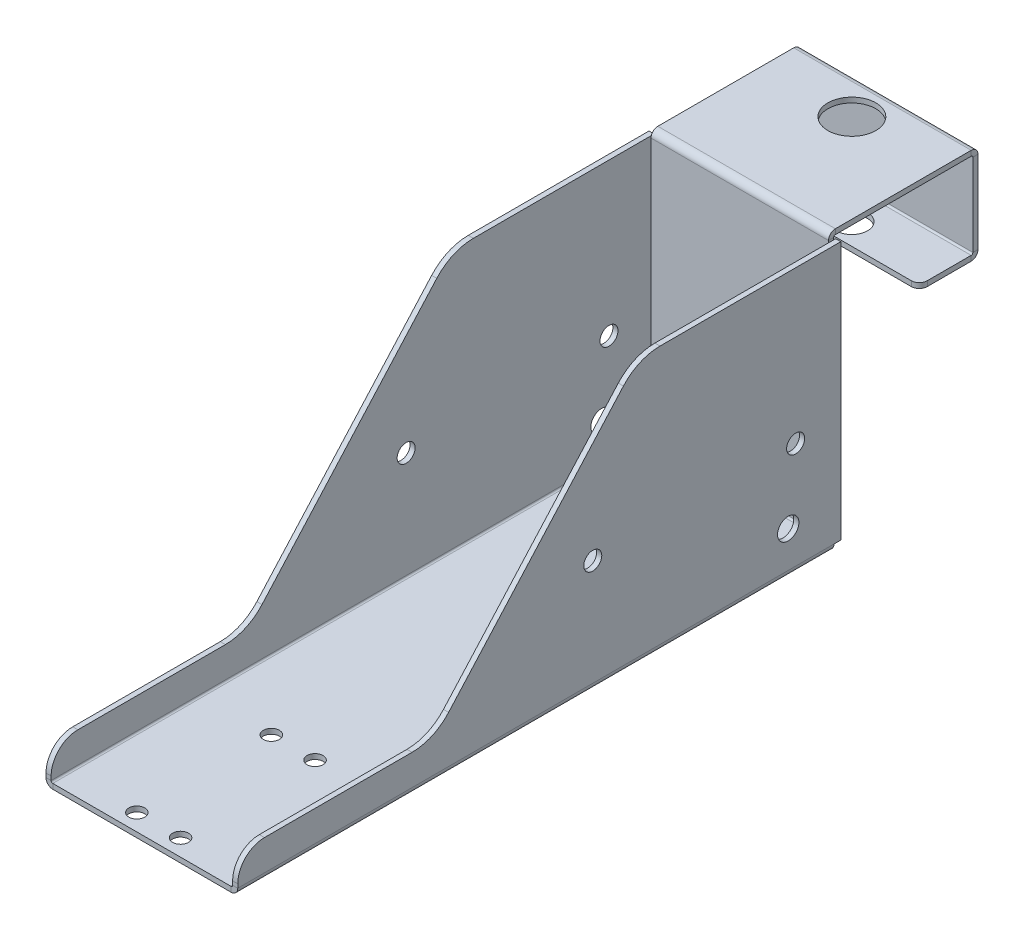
ISO-10303-21;
HEADER;
FILE_DESCRIPTION(('STEP AP214'),'2;1');
FILE_NAME('part.step','',(''),(''),'','','');
FILE_SCHEMA(('AUTOMOTIVE_DESIGN { 1 0 10303 214 1 1 1 1 }'));
ENDSEC;
DATA;
#1=APPLICATION_CONTEXT('core data for automotive mechanical design processes');
#2=APPLICATION_PROTOCOL_DEFINITION('international standard','automotive_design',2000,#1);
#3=PRODUCT_CONTEXT('',#1,'mechanical');
#4=PRODUCT('Part','Part','',(#3));
#5=PRODUCT_RELATED_PRODUCT_CATEGORY('part','',(#4));
#6=PRODUCT_DEFINITION_FORMATION('','',#4);
#7=PRODUCT_DEFINITION_CONTEXT('part definition',#1,'design');
#8=PRODUCT_DEFINITION('design','',#6,#7);
#9=PRODUCT_DEFINITION_SHAPE('','',#8);
#10=(LENGTH_UNIT() NAMED_UNIT(*) SI_UNIT(.MILLI.,.METRE.));
#11=(NAMED_UNIT(*) PLANE_ANGLE_UNIT() SI_UNIT($,.RADIAN.));
#12=(NAMED_UNIT(*) SI_UNIT($,.STERADIAN.) SOLID_ANGLE_UNIT());
#13=UNCERTAINTY_MEASURE_WITH_UNIT(LENGTH_MEASURE(1.E-05),#10,'distance_accuracy_value','');
#14=(GEOMETRIC_REPRESENTATION_CONTEXT(3) GLOBAL_UNCERTAINTY_ASSIGNED_CONTEXT((#13)) GLOBAL_UNIT_ASSIGNED_CONTEXT((#10,
#11,#12)) REPRESENTATION_CONTEXT('',''));
#15=CARTESIAN_POINT('',(0.,0.,0.));
#16=DIRECTION('',(0.,0.,1.));
#17=DIRECTION('',(1.,0.,0.));
#18=AXIS2_PLACEMENT_3D('',#15,#16,#17);
#19=CARTESIAN_POINT('',(389.614705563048,398.578429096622,-270.822499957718));
#20=DIRECTION('',(0.,-1.,0.));
#21=DIRECTION('',(0.,0.,-1.));
#22=AXIS2_PLACEMENT_3D('',#19,#20,#21);
#23=CYLINDRICAL_SURFACE('',#22,4.7625);
#24=CARTESIAN_POINT('',(389.614705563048,178.5952469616,-270.822499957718));
#25=DIRECTION('',(0.,-1.,0.));
#26=DIRECTION('',(0.,0.,-1.));
#27=AXIS2_PLACEMENT_3D('',#24,#25,#26);
#28=CIRCLE('',#27,4.7625);
#29=CARTESIAN_POINT('',(394.377205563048,178.5952469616,-270.822499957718));
#30=VERTEX_POINT('',#29);
#31=CARTESIAN_POINT('',(389.614705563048,178.5952469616,-266.059999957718));
#32=VERTEX_POINT('',#31);
#33=EDGE_CURVE('E97',#30,#32,#28,.T.);
#34=ORIENTED_EDGE('',*,*,#33,.F.);
#35=DIRECTION('',(0.,-1.,0.));
#36=VECTOR('',#35,1.);
#37=CARTESIAN_POINT('',(394.377205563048,398.578429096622,-270.822499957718));
#38=LINE('',#37,#36);
#39=CARTESIAN_POINT('',(394.377205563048,181.6432469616,-270.822499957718));
#40=VERTEX_POINT('',#39);
#41=EDGE_CURVE('E823',#40,#30,#38,.T.);
#42=ORIENTED_EDGE('',*,*,#41,.F.);
#43=CARTESIAN_POINT('',(389.614705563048,181.6432469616,-270.822499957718));
#44=DIRECTION('',(0.,-1.,0.));
#45=DIRECTION('',(0.,0.,-1.));
#46=AXIS2_PLACEMENT_3D('',#43,#44,#45);
#47=CIRCLE('',#46,4.7625);
#48=CARTESIAN_POINT('',(389.614705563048,181.6432469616,-266.059999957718));
#49=VERTEX_POINT('',#48);
#50=EDGE_CURVE('E51',#49,#40,#47,.F.);
#51=ORIENTED_EDGE('',*,*,#50,.F.);
#52=DIRECTION('',(0.,-1.,0.));
#53=VECTOR('',#52,1.);
#54=CARTESIAN_POINT('',(389.614705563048,398.578429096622,-266.059999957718));
#55=LINE('',#54,#53);
#56=EDGE_CURVE('E395',#49,#32,#55,.T.);
#57=ORIENTED_EDGE('',*,*,#56,.T.);
#58=EDGE_LOOP('',(#34,#42,#51,#57));
#59=FACE_BOUND('',#58,.T.);
#60=ADVANCED_FACE('F41',(#59),#23,.T.);
#61=CARTESIAN_POINT('',(395.567830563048,398.578429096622,-266.059999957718));
#62=DIRECTION('',(0.,0.,1.));
#63=DIRECTION('',(0.,-1.,0.));
#64=AXIS2_PLACEMENT_3D('',#61,#62,#63);
#65=PLANE('',#64);
#66=DIRECTION('',(0.,-1.,0.));
#67=VECTOR('',#66,1.);
#68=CARTESIAN_POINT('',(293.570955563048,398.578429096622,-266.059999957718));
#69=LINE('',#68,#67);
#70=CARTESIAN_POINT('',(293.570955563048,181.6432469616,-266.059999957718));
#71=VERTEX_POINT('',#70);
#72=CARTESIAN_POINT('',(293.570955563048,178.5952469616,-266.059999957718));
#73=VERTEX_POINT('',#72);
#74=EDGE_CURVE('E835',#71,#73,#69,.T.);
#75=ORIENTED_EDGE('',*,*,#74,.T.);
#76=DIRECTION('',(-1.,0.,0.));
#77=VECTOR('',#76,1.);
#78=CARTESIAN_POINT('',(395.567830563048,178.5952469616,-266.059999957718));
#79=LINE('',#78,#77);
#80=EDGE_CURVE('E90',#32,#73,#79,.T.);
#81=ORIENTED_EDGE('',*,*,#80,.F.);
#82=ORIENTED_EDGE('',*,*,#56,.F.);
#83=DIRECTION('',(-1.,0.,0.));
#84=VECTOR('',#83,1.);
#85=CARTESIAN_POINT('',(395.567830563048,181.6432469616,-266.059999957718));
#86=LINE('',#85,#84);
#87=EDGE_CURVE('E832',#49,#71,#86,.T.);
#88=ORIENTED_EDGE('',*,*,#87,.T.);
#89=EDGE_LOOP('',(#75,#81,#82,#88));
#90=FACE_BOUND('',#89,.T.);
#91=ADVANCED_FACE('F881',(#90),#65,.T.);
#92=CARTESIAN_POINT('',(341.592830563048,178.5952469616,-278.759999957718));
#93=DIRECTION('',(0.,-1.,0.));
#94=DIRECTION('',(0.,0.,-1.));
#95=AXIS2_PLACEMENT_3D('',#92,#93,#94);
#96=CYLINDRICAL_SURFACE('',#95,9.326626);
#97=CARTESIAN_POINT('',(341.592830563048,181.6432469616,-278.759999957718));
#98=DIRECTION('',(0.,-1.,0.));
#99=DIRECTION('',(0.,0.,-1.));
#100=AXIS2_PLACEMENT_3D('',#97,#98,#99);
#101=CIRCLE('',#100,9.326626);
#102=CARTESIAN_POINT('',(341.592830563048,181.6432469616,-288.086625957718));
#103=VERTEX_POINT('',#102);
#104=EDGE_CURVE('E815',#103,#103,#101,.T.);
#105=ORIENTED_EDGE('',*,*,#104,.F.);
#106=EDGE_LOOP('',(#105));
#107=FACE_BOUND('',#106,.T.);
#108=CARTESIAN_POINT('',(341.592830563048,178.5952469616,-278.759999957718));
#109=DIRECTION('',(0.,-1.,0.));
#110=DIRECTION('',(0.,0.,-1.));
#111=AXIS2_PLACEMENT_3D('',#108,#109,#110);
#112=CIRCLE('',#111,9.326626);
#113=CARTESIAN_POINT('',(341.592830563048,178.5952469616,-288.086625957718));
#114=VERTEX_POINT('',#113);
#115=EDGE_CURVE('E829',#114,#114,#112,.T.);
#116=ORIENTED_EDGE('',*,*,#115,.T.);
#117=EDGE_LOOP('',(#116));
#118=FACE_BOUND('',#117,.T.);
#119=ADVANCED_FACE('F886',(#107,#118),#96,.F.);
#120=CARTESIAN_POINT('',(293.570955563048,398.578429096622,-270.822499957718));
#121=DIRECTION('',(0.,-1.,0.));
#122=DIRECTION('',(0.,0.,-1.));
#123=AXIS2_PLACEMENT_3D('',#120,#121,#122);
#124=CYLINDRICAL_SURFACE('',#123,4.7625);
#125=CARTESIAN_POINT('',(293.570955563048,178.5952469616,-270.822499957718));
#126=DIRECTION('',(0.,-1.,0.));
#127=DIRECTION('',(0.,0.,-1.));
#128=AXIS2_PLACEMENT_3D('',#125,#126,#127);
#129=CIRCLE('',#128,4.7625);
#130=CARTESIAN_POINT('',(288.808455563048,178.5952469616,-270.822499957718));
#131=VERTEX_POINT('',#130);
#132=EDGE_CURVE('E372',#73,#131,#129,.T.);
#133=ORIENTED_EDGE('',*,*,#132,.F.);
#134=ORIENTED_EDGE('',*,*,#74,.F.);
#135=CARTESIAN_POINT('',(293.570955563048,181.6432469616,-270.822499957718));
#136=DIRECTION('',(0.,-1.,0.));
#137=DIRECTION('',(0.,0.,-1.));
#138=AXIS2_PLACEMENT_3D('',#135,#136,#137);
#139=CIRCLE('',#138,4.7625);
#140=CARTESIAN_POINT('',(288.808455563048,181.6432469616,-270.822499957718));
#141=VERTEX_POINT('',#140);
#142=EDGE_CURVE('E812',#141,#71,#139,.F.);
#143=ORIENTED_EDGE('',*,*,#142,.F.);
#144=DIRECTION('',(0.,-1.,0.));
#145=VECTOR('',#144,1.);
#146=CARTESIAN_POINT('',(288.808455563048,398.578429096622,-270.822499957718));
#147=LINE('',#146,#145);
#148=EDGE_CURVE('E385',#141,#131,#147,.T.);
#149=ORIENTED_EDGE('',*,*,#148,.T.);
#150=EDGE_LOOP('',(#133,#134,#143,#149));
#151=FACE_BOUND('',#150,.T.);
#152=ADVANCED_FACE('F893',(#151),#124,.T.);
#153=CARTESIAN_POINT('',(288.808455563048,398.578429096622,-296.936999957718));
#154=DIRECTION('',(1.,0.,0.));
#155=DIRECTION('',(0.,0.,1.));
#156=AXIS2_PLACEMENT_3D('',#153,#154,#155);
#157=PLANE('',#156);
#158=DIRECTION('',(0.,0.,-1.));
#159=VECTOR('',#158,1.);
#160=CARTESIAN_POINT('',(288.808455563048,178.5952469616,-266.059999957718));
#161=LINE('',#160,#159);
#162=CARTESIAN_POINT('',(288.808455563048,178.5952469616,-296.936999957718));
#163=VERTEX_POINT('',#162);
#164=EDGE_CURVE('E365',#131,#163,#161,.T.);
#165=ORIENTED_EDGE('',*,*,#164,.F.);
#166=ORIENTED_EDGE('',*,*,#148,.F.);
#167=DIRECTION('',(0.,0.,1.));
#168=VECTOR('',#167,1.);
#169=CARTESIAN_POINT('',(288.808455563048,181.6432469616,-296.936999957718));
#170=LINE('',#169,#168);
#171=CARTESIAN_POINT('',(288.808455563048,181.6432469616,-296.936999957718));
#172=VERTEX_POINT('',#171);
#173=EDGE_CURVE('E380',#172,#141,#170,.T.);
#174=ORIENTED_EDGE('',*,*,#173,.F.);
#175=DIRECTION('',(0.,-1.,0.));
#176=VECTOR('',#175,1.);
#177=CARTESIAN_POINT('',(288.808455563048,398.578429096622,-296.936999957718));
#178=LINE('',#177,#176);
#179=EDGE_CURVE('E378',#172,#163,#178,.T.);
#180=ORIENTED_EDGE('',*,*,#179,.T.);
#181=EDGE_LOOP('',(#165,#166,#174,#180));
#182=FACE_BOUND('',#181,.T.);
#183=ADVANCED_FACE('F379',(#182),#157,.F.);
#184=CARTESIAN_POINT('',(395.567830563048,178.5952469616,-296.936999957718));
#185=DIRECTION('',(0.,-1.,0.));
#186=DIRECTION('',(0.,0.,-1.));
#187=AXIS2_PLACEMENT_3D('',#184,#185,#186);
#188=PLANE('',#187);
#189=ORIENTED_EDGE('',*,*,#115,.F.);
#190=EDGE_LOOP('',(#189));
#191=FACE_BOUND('',#190,.T.);
#192=ORIENTED_EDGE('',*,*,#80,.T.);
#193=ORIENTED_EDGE('',*,*,#132,.T.);
#194=ORIENTED_EDGE('',*,*,#164,.T.);
#195=DIRECTION('',(-1.,0.,0.));
#196=VECTOR('',#195,1.);
#197=CARTESIAN_POINT('',(395.567830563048,178.5952469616,-296.936999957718));
#198=LINE('',#197,#196);
#199=CARTESIAN_POINT('',(394.377205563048,178.5952469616,-296.936999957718));
#200=VERTEX_POINT('',#199);
#201=EDGE_CURVE('E370',#200,#163,#198,.T.);
#202=ORIENTED_EDGE('',*,*,#201,.F.);
#203=DIRECTION('',(0.,0.,-1.));
#204=VECTOR('',#203,1.);
#205=CARTESIAN_POINT('',(394.377205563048,178.5952469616,-266.059999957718));
#206=LINE('',#205,#204);
#207=EDGE_CURVE('E821',#30,#200,#206,.T.);
#208=ORIENTED_EDGE('',*,*,#207,.F.);
#209=ORIENTED_EDGE('',*,*,#33,.T.);
#210=EDGE_LOOP('',(#192,#193,#194,#202,#208,#209));
#211=FACE_BOUND('',#210,.T.);
#212=ADVANCED_FACE('F367',(#191,#211),#188,.T.);
#213=CARTESIAN_POINT('',(394.377205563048,398.578429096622,-296.936999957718));
#214=DIRECTION('',(1.,0.,0.));
#215=DIRECTION('',(0.,0.,1.));
#216=AXIS2_PLACEMENT_3D('',#213,#214,#215);
#217=PLANE('',#216);
#218=ORIENTED_EDGE('',*,*,#41,.T.);
#219=ORIENTED_EDGE('',*,*,#207,.T.);
#220=DIRECTION('',(0.,-1.,0.));
#221=VECTOR('',#220,1.);
#222=CARTESIAN_POINT('',(394.377205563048,398.578429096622,-296.936999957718));
#223=LINE('',#222,#221);
#224=CARTESIAN_POINT('',(394.377205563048,181.6432469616,-296.936999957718));
#225=VERTEX_POINT('',#224);
#226=EDGE_CURVE('E45',#225,#200,#223,.T.);
#227=ORIENTED_EDGE('',*,*,#226,.F.);
#228=DIRECTION('',(0.,0.,1.));
#229=VECTOR('',#228,1.);
#230=CARTESIAN_POINT('',(394.377205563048,181.6432469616,-296.936999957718));
#231=LINE('',#230,#229);
#232=EDGE_CURVE('E818',#225,#40,#231,.T.);
#233=ORIENTED_EDGE('',*,*,#232,.T.);
#234=EDGE_LOOP('',(#218,#219,#227,#233));
#235=FACE_BOUND('',#234,.T.);
#236=ADVANCED_FACE('F841',(#235),#217,.T.);
#237=CARTESIAN_POINT('',(395.567830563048,181.6432469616,-296.936999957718));
#238=DIRECTION('',(0.,-1.,0.));
#239=DIRECTION('',(0.,0.,-1.));
#240=AXIS2_PLACEMENT_3D('',#237,#238,#239);
#241=PLANE('',#240);
#242=ORIENTED_EDGE('',*,*,#104,.T.);
#243=EDGE_LOOP('',(#242));
#244=FACE_BOUND('',#243,.T.);
#245=ORIENTED_EDGE('',*,*,#173,.T.);
#246=ORIENTED_EDGE('',*,*,#142,.T.);
#247=ORIENTED_EDGE('',*,*,#87,.F.);
#248=ORIENTED_EDGE('',*,*,#50,.T.);
#249=ORIENTED_EDGE('',*,*,#232,.F.);
#250=DIRECTION('',(-1.,0.,0.));
#251=VECTOR('',#250,1.);
#252=CARTESIAN_POINT('',(395.567830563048,181.6432469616,-296.936999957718));
#253=LINE('',#252,#251);
#254=EDGE_CURVE('E11',#225,#172,#253,.T.);
#255=ORIENTED_EDGE('',*,*,#254,.T.);
#256=EDGE_LOOP('',(#245,#246,#247,#248,#249,#255));
#257=FACE_BOUND('',#256,.T.);
#258=ADVANCED_FACE('F43',(#244,#257),#241,.F.);
#259=CARTESIAN_POINT('',(288.808455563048,231.6972469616,-68.1669947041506));
#260=DIRECTION('',(1.,0.,0.));
#261=DIRECTION('',(0.,-1.,0.));
#262=AXIS2_PLACEMENT_3D('',#259,#260,#261);
#263=PLANE('',#262);
#264=DIRECTION('',(0.,1.,0.));
#265=VECTOR('',#264,1.);
#266=CARTESIAN_POINT('',(288.808455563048,182.6432469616,-300.984999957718));
#267=LINE('',#266,#265);
#268=CARTESIAN_POINT('',(288.808455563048,182.6432469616,-300.984999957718));
#269=VERTEX_POINT('',#268);
#270=CARTESIAN_POINT('',(288.808455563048,231.6972469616,-300.984999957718));
#271=VERTEX_POINT('',#270);
#272=EDGE_CURVE('E131',#269,#271,#267,.T.);
#273=ORIENTED_EDGE('',*,*,#272,.F.);
#274=DIRECTION('',(0.,0.,-1.));
#275=VECTOR('',#274,1.);
#276=CARTESIAN_POINT('',(288.808455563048,182.6432469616,-68.1669947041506));
#277=LINE('',#276,#275);
#278=CARTESIAN_POINT('',(288.808455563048,182.6432469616,-297.936999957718));
#279=VERTEX_POINT('',#278);
#280=EDGE_CURVE('E398',#279,#269,#277,.T.);
#281=ORIENTED_EDGE('',*,*,#280,.F.);
#282=DIRECTION('',(0.,-1.,0.));
#283=VECTOR('',#282,1.);
#284=CARTESIAN_POINT('',(288.808455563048,231.6972469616,-297.936999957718));
#285=LINE('',#284,#283);
#286=CARTESIAN_POINT('',(288.808455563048,231.6972469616,-297.936999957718));
#287=VERTEX_POINT('',#286);
#288=EDGE_CURVE('E790',#287,#279,#285,.T.);
#289=ORIENTED_EDGE('',*,*,#288,.F.);
#290=DIRECTION('',(0.,0.,-1.));
#291=VECTOR('',#290,1.);
#292=CARTESIAN_POINT('',(288.808455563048,231.6972469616,-68.1669947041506));
#293=LINE('',#292,#291);
#294=EDGE_CURVE('E802',#287,#271,#293,.T.);
#295=ORIENTED_EDGE('',*,*,#294,.T.);
#296=EDGE_LOOP('',(#273,#281,#289,#295));
#297=FACE_BOUND('',#296,.T.);
#298=ADVANCED_FACE('F906',(#297),#263,.F.);
#299=CARTESIAN_POINT('',(395.567830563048,231.6972469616,-300.984999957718));
#300=DIRECTION('',(0.,0.,-1.));
#301=DIRECTION('',(-1.,0.,0.));
#302=AXIS2_PLACEMENT_3D('',#299,#300,#301);
#303=PLANE('',#302);
#304=DIRECTION('',(-1.,0.,0.));
#305=VECTOR('',#304,1.);
#306=CARTESIAN_POINT('',(395.567830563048,182.6432469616,-300.984999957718));
#307=LINE('',#306,#305);
#308=CARTESIAN_POINT('',(394.377205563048,182.6432469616,-300.984999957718));
#309=VERTEX_POINT('',#308);
#310=EDGE_CURVE('E800',#309,#269,#307,.T.);
#311=ORIENTED_EDGE('',*,*,#310,.T.);
#312=ORIENTED_EDGE('',*,*,#272,.T.);
#313=DIRECTION('',(-1.,0.,0.));
#314=VECTOR('',#313,1.);
#315=CARTESIAN_POINT('',(395.567830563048,231.6972469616,-300.984999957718));
#316=LINE('',#315,#314);
#317=CARTESIAN_POINT('',(394.377205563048,231.6972469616,-300.984999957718));
#318=VERTEX_POINT('',#317);
#319=EDGE_CURVE('E124',#318,#271,#316,.T.);
#320=ORIENTED_EDGE('',*,*,#319,.F.);
#321=DIRECTION('',(0.,1.,0.));
#322=VECTOR('',#321,1.);
#323=CARTESIAN_POINT('',(394.377205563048,182.6432469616,-300.984999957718));
#324=LINE('',#323,#322);
#325=EDGE_CURVE('E795',#309,#318,#324,.T.);
#326=ORIENTED_EDGE('',*,*,#325,.F.);
#327=EDGE_LOOP('',(#311,#312,#320,#326));
#328=FACE_BOUND('',#327,.T.);
#329=ADVANCED_FACE('F911',(#328),#303,.T.);
#330=CARTESIAN_POINT('',(394.377205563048,231.6972469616,-68.1669947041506));
#331=DIRECTION('',(1.,0.,0.));
#332=DIRECTION('',(0.,-1.,0.));
#333=AXIS2_PLACEMENT_3D('',#330,#331,#332);
#334=PLANE('',#333);
#335=DIRECTION('',(0.,0.,-1.));
#336=VECTOR('',#335,1.);
#337=CARTESIAN_POINT('',(394.377205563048,182.6432469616,-68.1669947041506));
#338=LINE('',#337,#336);
#339=CARTESIAN_POINT('',(394.377205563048,182.6432469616,-297.936999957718));
#340=VERTEX_POINT('',#339);
#341=EDGE_CURVE('E797',#340,#309,#338,.T.);
#342=ORIENTED_EDGE('',*,*,#341,.T.);
#343=ORIENTED_EDGE('',*,*,#325,.T.);
#344=DIRECTION('',(0.,0.,-1.));
#345=VECTOR('',#344,1.);
#346=CARTESIAN_POINT('',(394.377205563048,231.6972469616,-68.1669947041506));
#347=LINE('',#346,#345);
#348=CARTESIAN_POINT('',(394.377205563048,231.6972469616,-297.936999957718));
#349=VERTEX_POINT('',#348);
#350=EDGE_CURVE('E759',#349,#318,#347,.T.);
#351=ORIENTED_EDGE('',*,*,#350,.F.);
#352=DIRECTION('',(0.,-1.,0.));
#353=VECTOR('',#352,1.);
#354=CARTESIAN_POINT('',(394.377205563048,231.6972469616,-297.936999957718));
#355=LINE('',#354,#353);
#356=EDGE_CURVE('E792',#349,#340,#355,.T.);
#357=ORIENTED_EDGE('',*,*,#356,.T.);
#358=EDGE_LOOP('',(#342,#343,#351,#357));
#359=FACE_BOUND('',#358,.T.);
#360=ADVANCED_FACE('F851',(#359),#334,.T.);
#361=CARTESIAN_POINT('',(395.567830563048,231.6972469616,-297.936999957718));
#362=DIRECTION('',(0.,0.,-1.));
#363=DIRECTION('',(-1.,0.,0.));
#364=AXIS2_PLACEMENT_3D('',#361,#362,#363);
#365=PLANE('',#364);
#366=ORIENTED_EDGE('',*,*,#288,.T.);
#367=DIRECTION('',(-1.,0.,0.));
#368=VECTOR('',#367,1.);
#369=CARTESIAN_POINT('',(395.567830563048,182.6432469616,-297.936999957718));
#370=LINE('',#369,#368);
#371=EDGE_CURVE('E805',#340,#279,#370,.T.);
#372=ORIENTED_EDGE('',*,*,#371,.F.);
#373=ORIENTED_EDGE('',*,*,#356,.F.);
#374=DIRECTION('',(-1.,0.,0.));
#375=VECTOR('',#374,1.);
#376=CARTESIAN_POINT('',(395.567830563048,231.6972469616,-297.936999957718));
#377=LINE('',#376,#375);
#378=EDGE_CURVE('E106',#349,#287,#377,.T.);
#379=ORIENTED_EDGE('',*,*,#378,.T.);
#380=EDGE_LOOP('',(#366,#372,#373,#379));
#381=FACE_BOUND('',#380,.T.);
#382=ADVANCED_FACE('F848',(#381),#365,.F.);
#383=CARTESIAN_POINT('',(341.592830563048,-2.2537530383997,-278.759999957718));
#384=DIRECTION('',(0.,1.,0.));
#385=DIRECTION('',(0.,0.,1.));
#386=AXIS2_PLACEMENT_3D('',#383,#384,#385);
#387=CYLINDRICAL_SURFACE('',#386,14.2875);
#388=CARTESIAN_POINT('',(341.592830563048,235.7452469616,-278.759999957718));
#389=DIRECTION('',(0.,1.,0.));
#390=DIRECTION('',(0.,0.,1.));
#391=AXIS2_PLACEMENT_3D('',#388,#389,#390);
#392=CIRCLE('',#391,14.2875);
#393=CARTESIAN_POINT('',(341.592830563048,235.7452469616,-264.472499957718));
#394=VERTEX_POINT('',#393);
#395=EDGE_CURVE('E780',#394,#394,#392,.T.);
#396=CARTESIAN_POINT('',(341.592830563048,232.6972469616,-278.759999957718));
#397=DIRECTION('',(0.,1.,0.));
#398=DIRECTION('',(0.,0.,1.));
#399=AXIS2_PLACEMENT_3D('',#396,#397,#398);
#400=CIRCLE('',#399,14.2875);
#401=CARTESIAN_POINT('',(341.592830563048,232.6972469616,-264.472499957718));
#402=VERTEX_POINT('',#401);
#403=EDGE_CURVE('E777',#402,#402,#400,.F.);
#404=CARTESIAN_POINT('',(341.592830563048,235.7452469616,-264.472499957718));
#405=CARTESIAN_POINT('',(341.592830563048,235.7134969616,-264.472499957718));
#406=CARTESIAN_POINT('',(341.592830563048,235.6817469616,-264.472499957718));
#407=CARTESIAN_POINT('',(341.592830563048,235.6182469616,-264.472499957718));
#408=CARTESIAN_POINT('',(341.592830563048,235.5864969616,-264.472499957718));
#409=CARTESIAN_POINT('',(341.592830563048,235.5229969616,-264.472499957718));
#410=CARTESIAN_POINT('',(341.592830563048,235.4912469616,-264.472499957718));
#411=CARTESIAN_POINT('',(341.592830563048,235.4277469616,-264.472499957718));
#412=CARTESIAN_POINT('',(341.592830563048,235.3959969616,-264.472499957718));
#413=CARTESIAN_POINT('',(341.592830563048,235.3324969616,-264.472499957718));
#414=CARTESIAN_POINT('',(341.592830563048,235.3007469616,-264.472499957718));
#415=CARTESIAN_POINT('',(341.592830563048,235.2372469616,-264.472499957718));
#416=CARTESIAN_POINT('',(341.592830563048,235.2054969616,-264.472499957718));
#417=CARTESIAN_POINT('',(341.592830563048,235.1419969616,-264.472499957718));
#418=CARTESIAN_POINT('',(341.592830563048,235.1102469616,-264.472499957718));
#419=CARTESIAN_POINT('',(341.592830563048,235.0467469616,-264.472499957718));
#420=CARTESIAN_POINT('',(341.592830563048,235.0149969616,-264.472499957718));
#421=CARTESIAN_POINT('',(341.592830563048,234.9514969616,-264.472499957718));
#422=CARTESIAN_POINT('',(341.592830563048,234.9197469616,-264.472499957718));
#423=CARTESIAN_POINT('',(341.592830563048,234.8562469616,-264.472499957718));
#424=CARTESIAN_POINT('',(341.592830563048,234.8244969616,-264.472499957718));
#425=CARTESIAN_POINT('',(341.592830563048,234.7609969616,-264.472499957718));
#426=CARTESIAN_POINT('',(341.592830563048,234.7292469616,-264.472499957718));
#427=CARTESIAN_POINT('',(341.592830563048,234.6657469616,-264.472499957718));
#428=CARTESIAN_POINT('',(341.592830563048,234.6339969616,-264.472499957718));
#429=CARTESIAN_POINT('',(341.592830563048,234.5704969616,-264.472499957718));
#430=CARTESIAN_POINT('',(341.592830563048,234.5387469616,-264.472499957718));
#431=CARTESIAN_POINT('',(341.592830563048,234.4752469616,-264.472499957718));
#432=CARTESIAN_POINT('',(341.592830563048,234.4434969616,-264.472499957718));
#433=CARTESIAN_POINT('',(341.592830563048,234.3799969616,-264.472499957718));
#434=CARTESIAN_POINT('',(341.592830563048,234.3482469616,-264.472499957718));
#435=CARTESIAN_POINT('',(341.592830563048,234.2847469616,-264.472499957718));
#436=CARTESIAN_POINT('',(341.592830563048,234.2529969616,-264.472499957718));
#437=CARTESIAN_POINT('',(341.592830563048,234.1894969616,-264.472499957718));
#438=CARTESIAN_POINT('',(341.592830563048,234.1577469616,-264.472499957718));
#439=CARTESIAN_POINT('',(341.592830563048,234.0942469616,-264.472499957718));
#440=CARTESIAN_POINT('',(341.592830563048,234.0624969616,-264.472499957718));
#441=CARTESIAN_POINT('',(341.592830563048,233.9989969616,-264.472499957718));
#442=CARTESIAN_POINT('',(341.592830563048,233.9672469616,-264.472499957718));
#443=CARTESIAN_POINT('',(341.592830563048,233.9037469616,-264.472499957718));
#444=CARTESIAN_POINT('',(341.592830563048,233.8719969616,-264.472499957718));
#445=CARTESIAN_POINT('',(341.592830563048,233.8084969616,-264.472499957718));
#446=CARTESIAN_POINT('',(341.592830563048,233.7767469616,-264.472499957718));
#447=CARTESIAN_POINT('',(341.592830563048,233.7132469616,-264.472499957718));
#448=CARTESIAN_POINT('',(341.592830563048,233.6814969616,-264.472499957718));
#449=CARTESIAN_POINT('',(341.592830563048,233.6179969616,-264.472499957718));
#450=CARTESIAN_POINT('',(341.592830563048,233.5862469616,-264.472499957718));
#451=CARTESIAN_POINT('',(341.592830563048,233.5227469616,-264.472499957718));
#452=CARTESIAN_POINT('',(341.592830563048,233.4909969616,-264.472499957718));
#453=CARTESIAN_POINT('',(341.592830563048,233.4274969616,-264.472499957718));
#454=CARTESIAN_POINT('',(341.592830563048,233.3957469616,-264.472499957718));
#455=CARTESIAN_POINT('',(341.592830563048,233.3322469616,-264.472499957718));
#456=CARTESIAN_POINT('',(341.592830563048,233.3004969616,-264.472499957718));
#457=CARTESIAN_POINT('',(341.592830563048,233.2369969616,-264.472499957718));
#458=CARTESIAN_POINT('',(341.592830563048,233.2052469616,-264.472499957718));
#459=CARTESIAN_POINT('',(341.592830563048,233.1417469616,-264.472499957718));
#460=CARTESIAN_POINT('',(341.592830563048,233.1099969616,-264.472499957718));
#461=CARTESIAN_POINT('',(341.592830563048,233.0464969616,-264.472499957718));
#462=CARTESIAN_POINT('',(341.592830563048,233.0147469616,-264.472499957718));
#463=CARTESIAN_POINT('',(341.592830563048,232.9512469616,-264.472499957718));
#464=CARTESIAN_POINT('',(341.592830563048,232.9194969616,-264.472499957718));
#465=CARTESIAN_POINT('',(341.592830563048,232.8559969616,-264.472499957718));
#466=CARTESIAN_POINT('',(341.592830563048,232.8242469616,-264.472499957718));
#467=CARTESIAN_POINT('',(341.592830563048,232.7607469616,-264.472499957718));
#468=CARTESIAN_POINT('',(341.592830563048,232.7289969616,-264.472499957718));
#469=CARTESIAN_POINT('',(341.592830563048,232.6972469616,-264.472499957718));
#470=B_SPLINE_CURVE_WITH_KNOTS('',3,(#404,#405,#406,#407,#408,#409,#410,#411,#412,#413,#414,
#415,#416,#417,#418,#419,#420,#421,#422,#423,#424,#425,#426,#427,#428,#429,#430,#431,#432,#433,
#434,#435,#436,#437,#438,#439,#440,#441,#442,#443,#444,#445,#446,#447,#448,#449,#450,#451,#452,
#453,#454,#455,#456,#457,#458,#459,#460,#461,#462,#463,#464,#465,#466,#467,#468,#469),
.UNSPECIFIED.,.F.,.F.,(4,2,2,2,2,2,2,2,2,2,2,2,2,2,2,2,2,2,2,2,2,2,2,2,2,2,2,2,2,2,2,2,4),(0.,
0.0952499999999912,0.19050000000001,0.285750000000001,0.380999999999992,0.476250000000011,
0.571500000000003,0.666749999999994,0.761999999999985,0.857250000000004,0.952499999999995,
1.04774999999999,1.14300000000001,1.23825,1.33349999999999,1.42875000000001,1.524,
1.61924999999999,1.71450000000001,1.80975,1.90499999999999,2.00025000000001,2.0955,
2.19074999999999,2.28600000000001,2.38125,2.47649999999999,2.57174999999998,2.667,
2.76224999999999,2.85749999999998,2.95275,3.048),.UNSPECIFIED.);
#471=EDGE_CURVE('BSEAM929',#394,#402,#470,.T.);
#472=ORIENTED_EDGE('',*,*,#395,.T.);
#473=ORIENTED_EDGE('',*,*,#403,.T.);
#474=ORIENTED_EDGE('',*,*,#471,.T.);
#475=ORIENTED_EDGE('',*,*,#471,.F.);
#476=EDGE_LOOP('',(#472,#474,#473,#475));
#477=FACE_BOUND('',#476,.T.);
#478=ADVANCED_FACE('F929',(#477),#387,.F.);
#479=CARTESIAN_POINT('',(288.808455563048,-30.1423036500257,-216.132999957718));
#480=DIRECTION('',(1.,0.,0.));
#481=DIRECTION('',(0.,0.,-1.));
#482=AXIS2_PLACEMENT_3D('',#479,#480,#481);
#483=PLANE('',#482);
#484=DIRECTION('',(0.,0.,1.));
#485=VECTOR('',#484,1.);
#486=CARTESIAN_POINT('',(288.808455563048,235.7452469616,-296.936999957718));
#487=LINE('',#486,#485);
#488=CARTESIAN_POINT('',(288.808455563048,235.7452469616,-296.936999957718));
#489=VERTEX_POINT('',#488);
#490=CARTESIAN_POINT('',(288.808455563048,235.7452469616,-216.132999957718));
#491=VERTEX_POINT('',#490);
#492=EDGE_CURVE('E164',#489,#491,#487,.T.);
#493=ORIENTED_EDGE('',*,*,#492,.F.);
#494=DIRECTION('',(0.,1.,0.));
#495=VECTOR('',#494,1.);
#496=CARTESIAN_POINT('',(288.808455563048,-30.1423036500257,-296.936999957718));
#497=LINE('',#496,#495);
#498=CARTESIAN_POINT('',(288.808455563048,232.6972469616,-296.936999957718));
#499=VERTEX_POINT('',#498);
#500=EDGE_CURVE('E774',#499,#489,#497,.T.);
#501=ORIENTED_EDGE('',*,*,#500,.F.);
#502=DIRECTION('',(0.,0.,-1.));
#503=VECTOR('',#502,1.);
#504=CARTESIAN_POINT('',(288.808455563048,232.6972469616,-216.132999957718));
#505=LINE('',#504,#503);
#506=CARTESIAN_POINT('',(288.808455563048,232.6972469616,-216.132999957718));
#507=VERTEX_POINT('',#506);
#508=EDGE_CURVE('E760',#507,#499,#505,.T.);
#509=ORIENTED_EDGE('',*,*,#508,.F.);
#510=DIRECTION('',(0.,1.,0.));
#511=VECTOR('',#510,1.);
#512=CARTESIAN_POINT('',(288.808455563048,-30.1423036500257,-216.132999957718));
#513=LINE('',#512,#511);
#514=EDGE_CURVE('E772',#507,#491,#513,.T.);
#515=ORIENTED_EDGE('',*,*,#514,.T.);
#516=EDGE_LOOP('',(#493,#501,#509,#515));
#517=FACE_BOUND('',#516,.T.);
#518=ADVANCED_FACE('F933',(#517),#483,.F.);
#519=CARTESIAN_POINT('',(395.567830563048,235.7452469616,-216.132999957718));
#520=DIRECTION('',(0.,1.,0.));
#521=DIRECTION('',(0.,0.,1.));
#522=AXIS2_PLACEMENT_3D('',#519,#520,#521);
#523=PLANE('',#522);
#524=ORIENTED_EDGE('',*,*,#395,.F.);
#525=EDGE_LOOP('',(#524));
#526=FACE_BOUND('',#525,.T.);
#527=DIRECTION('',(-1.,0.,0.));
#528=VECTOR('',#527,1.);
#529=CARTESIAN_POINT('',(395.567830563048,235.7452469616,-296.936999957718));
#530=LINE('',#529,#528);
#531=CARTESIAN_POINT('',(394.377205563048,235.7452469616,-296.936999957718));
#532=VERTEX_POINT('',#531);
#533=EDGE_CURVE('E770',#532,#489,#530,.T.);
#534=ORIENTED_EDGE('',*,*,#533,.T.);
#535=ORIENTED_EDGE('',*,*,#492,.T.);
#536=DIRECTION('',(-1.,0.,0.));
#537=VECTOR('',#536,1.);
#538=CARTESIAN_POINT('',(395.567830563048,235.7452469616,-216.132999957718));
#539=LINE('',#538,#537);
#540=CARTESIAN_POINT('',(394.377205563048,235.7452469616,-216.132999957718));
#541=VERTEX_POINT('',#540);
#542=EDGE_CURVE('E158',#541,#491,#539,.T.);
#543=ORIENTED_EDGE('',*,*,#542,.F.);
#544=DIRECTION('',(0.,0.,1.));
#545=VECTOR('',#544,1.);
#546=CARTESIAN_POINT('',(394.377205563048,235.7452469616,-296.936999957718));
#547=LINE('',#546,#545);
#548=EDGE_CURVE('E765',#532,#541,#547,.T.);
#549=ORIENTED_EDGE('',*,*,#548,.F.);
#550=EDGE_LOOP('',(#534,#535,#543,#549));
#551=FACE_BOUND('',#550,.T.);
#552=ADVANCED_FACE('F864',(#526,#551),#523,.T.);
#553=CARTESIAN_POINT('',(394.377205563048,-30.1423036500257,-216.132999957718));
#554=DIRECTION('',(1.,0.,0.));
#555=DIRECTION('',(0.,0.,-1.));
#556=AXIS2_PLACEMENT_3D('',#553,#554,#555);
#557=PLANE('',#556);
#558=DIRECTION('',(0.,1.,0.));
#559=VECTOR('',#558,1.);
#560=CARTESIAN_POINT('',(394.377205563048,-30.1423036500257,-296.936999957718));
#561=LINE('',#560,#559);
#562=CARTESIAN_POINT('',(394.377205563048,232.6972469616,-296.936999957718));
#563=VERTEX_POINT('',#562);
#564=EDGE_CURVE('E767',#563,#532,#561,.T.);
#565=ORIENTED_EDGE('',*,*,#564,.T.);
#566=ORIENTED_EDGE('',*,*,#548,.T.);
#567=DIRECTION('',(0.,1.,0.));
#568=VECTOR('',#567,1.);
#569=CARTESIAN_POINT('',(394.377205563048,-30.1423036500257,-216.132999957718));
#570=LINE('',#569,#568);
#571=CARTESIAN_POINT('',(394.377205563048,232.6972469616,-216.132999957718));
#572=VERTEX_POINT('',#571);
#573=EDGE_CURVE('E757',#572,#541,#570,.T.);
#574=ORIENTED_EDGE('',*,*,#573,.F.);
#575=DIRECTION('',(0.,0.,-1.));
#576=VECTOR('',#575,1.);
#577=CARTESIAN_POINT('',(394.377205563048,232.6972469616,-216.132999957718));
#578=LINE('',#577,#576);
#579=EDGE_CURVE('E762',#572,#563,#578,.T.);
#580=ORIENTED_EDGE('',*,*,#579,.T.);
#581=EDGE_LOOP('',(#565,#566,#574,#580));
#582=FACE_BOUND('',#581,.T.);
#583=ADVANCED_FACE('F862',(#582),#557,.T.);
#584=CARTESIAN_POINT('',(395.567830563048,232.6972469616,-216.132999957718));
#585=DIRECTION('',(0.,1.,0.));
#586=DIRECTION('',(0.,0.,1.));
#587=AXIS2_PLACEMENT_3D('',#584,#585,#586);
#588=PLANE('',#587);
#589=ORIENTED_EDGE('',*,*,#403,.F.);
#590=EDGE_LOOP('',(#589));
#591=FACE_BOUND('',#590,.T.);
#592=ORIENTED_EDGE('',*,*,#508,.T.);
#593=DIRECTION('',(-1.,0.,0.));
#594=VECTOR('',#593,1.);
#595=CARTESIAN_POINT('',(395.567830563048,232.6972469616,-296.936999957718));
#596=LINE('',#595,#594);
#597=EDGE_CURVE('E783',#563,#499,#596,.T.);
#598=ORIENTED_EDGE('',*,*,#597,.F.);
#599=ORIENTED_EDGE('',*,*,#579,.F.);
#600=DIRECTION('',(-1.,0.,0.));
#601=VECTOR('',#600,1.);
#602=CARTESIAN_POINT('',(395.567830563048,232.6972469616,-216.132999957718));
#603=LINE('',#602,#601);
#604=EDGE_CURVE('E140',#572,#507,#603,.T.);
#605=ORIENTED_EDGE('',*,*,#604,.T.);
#606=EDGE_LOOP('',(#592,#598,#599,#605));
#607=FACE_BOUND('',#606,.T.);
#608=ADVANCED_FACE('F923',(#591,#607),#588,.F.);
#609=CARTESIAN_POINT('',(395.567830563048,77.9952469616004,-212.084999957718));
#610=DIRECTION('',(0.,0.,1.));
#611=DIRECTION('',(1.,0.,0.));
#612=AXIS2_PLACEMENT_3D('',#609,#610,#611);
#613=PLANE('',#612);
#614=DIRECTION('',(-1.,0.,0.));
#615=VECTOR('',#614,1.);
#616=CARTESIAN_POINT('',(395.567830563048,231.6972469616,-212.084999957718));
#617=LINE('',#616,#615);
#618=CARTESIAN_POINT('',(394.377205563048,231.6972469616,-212.084999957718));
#619=VERTEX_POINT('',#618);
#620=CARTESIAN_POINT('',(288.808455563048,231.6972469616,-212.084999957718));
#621=VERTEX_POINT('',#620);
#622=EDGE_CURVE('E736',#619,#621,#617,.T.);
#623=ORIENTED_EDGE('',*,*,#622,.T.);
#624=DIRECTION('',(0.,-1.,0.));
#625=VECTOR('',#624,1.);
#626=CARTESIAN_POINT('',(288.808455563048,231.6972469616,-212.084999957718));
#627=LINE('',#626,#625);
#628=CARTESIAN_POINT('',(288.808455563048,77.9952469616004,-212.084999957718));
#629=VERTEX_POINT('',#628);
#630=EDGE_CURVE('E739',#621,#629,#627,.T.);
#631=ORIENTED_EDGE('',*,*,#630,.T.);
#632=DIRECTION('',(-1.,0.,0.));
#633=VECTOR('',#632,1.);
#634=CARTESIAN_POINT('',(395.567830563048,77.9952469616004,-212.084999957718));
#635=LINE('',#634,#633);
#636=CARTESIAN_POINT('',(394.377205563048,77.9952469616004,-212.084999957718));
#637=VERTEX_POINT('',#636);
#638=EDGE_CURVE('E742',#637,#629,#635,.T.);
#639=ORIENTED_EDGE('',*,*,#638,.F.);
#640=DIRECTION('',(0.,-1.,0.));
#641=VECTOR('',#640,1.);
#642=CARTESIAN_POINT('',(394.377205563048,231.6972469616,-212.084999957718));
#643=LINE('',#642,#641);
#644=EDGE_CURVE('E744',#619,#637,#643,.T.);
#645=ORIENTED_EDGE('',*,*,#644,.F.);
#646=EDGE_LOOP('',(#623,#631,#639,#645));
#647=FACE_BOUND('',#646,.T.);
#648=ADVANCED_FACE('F951',(#647),#613,.T.);
#649=CARTESIAN_POINT('',(288.808455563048,231.6972469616,160.844300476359));
#650=DIRECTION('',(1.,0.,0.));
#651=DIRECTION('',(0.,1.,0.));
#652=AXIS2_PLACEMENT_3D('',#649,#650,#651);
#653=PLANE('',#652);
#654=DIRECTION('',(0.,0.,-1.));
#655=VECTOR('',#654,1.);
#656=CARTESIAN_POINT('',(288.808455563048,231.6972469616,160.844300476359));
#657=LINE('',#656,#655);
#658=CARTESIAN_POINT('',(288.808455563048,231.6972469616,-215.132999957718));
#659=VERTEX_POINT('',#658);
#660=EDGE_CURVE('E754',#621,#659,#657,.T.);
#661=ORIENTED_EDGE('',*,*,#660,.T.);
#662=DIRECTION('',(0.,1.,0.));
#663=VECTOR('',#662,1.);
#664=CARTESIAN_POINT('',(288.808455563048,77.9952469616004,-215.132999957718));
#665=LINE('',#664,#663);
#666=CARTESIAN_POINT('',(288.808455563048,77.9952469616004,-215.132999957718));
#667=VERTEX_POINT('',#666);
#668=EDGE_CURVE('E725',#667,#659,#665,.T.);
#669=ORIENTED_EDGE('',*,*,#668,.F.);
#670=DIRECTION('',(0.,0.,-1.));
#671=VECTOR('',#670,1.);
#672=CARTESIAN_POINT('',(288.808455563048,77.9952469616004,160.844300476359));
#673=LINE('',#672,#671);
#674=EDGE_CURVE('E752',#629,#667,#673,.T.);
#675=ORIENTED_EDGE('',*,*,#674,.F.);
#676=ORIENTED_EDGE('',*,*,#630,.F.);
#677=EDGE_LOOP('',(#661,#669,#675,#676));
#678=FACE_BOUND('',#677,.T.);
#679=ADVANCED_FACE('F942',(#678),#653,.F.);
#680=CARTESIAN_POINT('',(394.377205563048,231.6972469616,160.844300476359));
#681=DIRECTION('',(1.,0.,0.));
#682=DIRECTION('',(0.,1.,0.));
#683=AXIS2_PLACEMENT_3D('',#680,#681,#682);
#684=PLANE('',#683);
#685=DIRECTION('',(0.,1.,0.));
#686=VECTOR('',#685,1.);
#687=CARTESIAN_POINT('',(394.377205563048,77.9952469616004,-215.132999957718));
#688=LINE('',#687,#686);
#689=CARTESIAN_POINT('',(394.377205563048,77.9952469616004,-215.132999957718));
#690=VERTEX_POINT('',#689);
#691=CARTESIAN_POINT('',(394.377205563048,231.6972469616,-215.132999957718));
#692=VERTEX_POINT('',#691);
#693=EDGE_CURVE('E730',#690,#692,#688,.T.);
#694=ORIENTED_EDGE('',*,*,#693,.T.);
#695=DIRECTION('',(0.,0.,-1.));
#696=VECTOR('',#695,1.);
#697=CARTESIAN_POINT('',(394.377205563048,231.6972469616,160.844300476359));
#698=LINE('',#697,#696);
#699=EDGE_CURVE('E747',#619,#692,#698,.T.);
#700=ORIENTED_EDGE('',*,*,#699,.F.);
#701=ORIENTED_EDGE('',*,*,#644,.T.);
#702=DIRECTION('',(0.,0.,-1.));
#703=VECTOR('',#702,1.);
#704=CARTESIAN_POINT('',(394.377205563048,77.9952469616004,160.844300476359));
#705=LINE('',#704,#703);
#706=EDGE_CURVE('E749',#637,#690,#705,.T.);
#707=ORIENTED_EDGE('',*,*,#706,.T.);
#708=EDGE_LOOP('',(#694,#700,#701,#707));
#709=FACE_BOUND('',#708,.T.);
#710=ADVANCED_FACE('F980',(#709),#684,.T.);
#711=CARTESIAN_POINT('',(395.567830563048,77.9952469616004,-215.132999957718));
#712=DIRECTION('',(0.,0.,1.));
#713=DIRECTION('',(1.,0.,0.));
#714=AXIS2_PLACEMENT_3D('',#711,#712,#713);
#715=PLANE('',#714);
#716=ORIENTED_EDGE('',*,*,#668,.T.);
#717=DIRECTION('',(-1.,0.,0.));
#718=VECTOR('',#717,1.);
#719=CARTESIAN_POINT('',(395.567830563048,231.6972469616,-215.132999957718));
#720=LINE('',#719,#718);
#721=EDGE_CURVE('E728',#692,#659,#720,.T.);
#722=ORIENTED_EDGE('',*,*,#721,.F.);
#723=ORIENTED_EDGE('',*,*,#693,.F.);
#724=DIRECTION('',(-1.,0.,0.));
#725=VECTOR('',#724,1.);
#726=CARTESIAN_POINT('',(395.567830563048,77.9952469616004,-215.132999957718));
#727=LINE('',#726,#725);
#728=EDGE_CURVE('E733',#690,#667,#727,.T.);
#729=ORIENTED_EDGE('',*,*,#728,.T.);
#730=EDGE_LOOP('',(#716,#722,#723,#729));
#731=FACE_BOUND('',#730,.T.);
#732=ADVANCED_FACE('F971',(#731),#715,.F.);
#733=CARTESIAN_POINT('',(398.615830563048,141.145573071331,-67.6255941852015));
#734=DIRECTION('',(1.,0.,0.));
#735=DIRECTION('',(0.,0.,-1.));
#736=AXIS2_PLACEMENT_3D('',#733,#734,#735);
#737=CYLINDRICAL_SURFACE('',#736,5.357876);
#738=CARTESIAN_POINT('',(398.615830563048,141.145573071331,-67.6255941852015));
#739=DIRECTION('',(1.,0.,0.));
#740=DIRECTION('',(0.,0.,-1.));
#741=AXIS2_PLACEMENT_3D('',#738,#739,#740);
#742=CIRCLE('',#741,5.35787600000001);
#743=CARTESIAN_POINT('',(398.615830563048,141.145573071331,-72.9834701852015));
#744=VERTEX_POINT('',#743);
#745=EDGE_CURVE('E441',#744,#744,#742,.T.);
#746=ORIENTED_EDGE('',*,*,#745,.T.);
#747=EDGE_LOOP('',(#746));
#748=FACE_BOUND('',#747,.T.);
#749=CARTESIAN_POINT('',(395.567830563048,141.145573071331,-67.6255941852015));
#750=DIRECTION('',(1.,0.,0.));
#751=DIRECTION('',(0.,0.,-1.));
#752=AXIS2_PLACEMENT_3D('',#749,#750,#751);
#753=CIRCLE('',#752,5.357876);
#754=CARTESIAN_POINT('',(395.567830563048,141.145573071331,-72.9834701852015));
#755=VERTEX_POINT('',#754);
#756=EDGE_CURVE('E563',#755,#755,#753,.T.);
#757=ORIENTED_EDGE('',*,*,#756,.F.);
#758=EDGE_LOOP('',(#757));
#759=FACE_BOUND('',#758,.T.);
#760=ADVANCED_FACE('F1109',(#748,#759),#737,.F.);
#761=CARTESIAN_POINT('',(398.615830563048,141.145573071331,-188.275594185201));
#762=DIRECTION('',(1.,0.,0.));
#763=DIRECTION('',(0.,0.,-1.));
#764=AXIS2_PLACEMENT_3D('',#761,#762,#763);
#765=CYLINDRICAL_SURFACE('',#764,5.357876);
#766=CARTESIAN_POINT('',(398.615830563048,141.145573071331,-188.275594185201));
#767=DIRECTION('',(1.,0.,0.));
#768=DIRECTION('',(0.,0.,-1.));
#769=AXIS2_PLACEMENT_3D('',#766,#767,#768);
#770=CIRCLE('',#769,5.35787600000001);
#771=CARTESIAN_POINT('',(398.615830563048,141.145573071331,-193.633470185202));
#772=VERTEX_POINT('',#771);
#773=EDGE_CURVE('E719',#772,#772,#770,.T.);
#774=ORIENTED_EDGE('',*,*,#773,.T.);
#775=EDGE_LOOP('',(#774));
#776=FACE_BOUND('',#775,.T.);
#777=CARTESIAN_POINT('',(395.567830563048,141.145573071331,-188.275594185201));
#778=DIRECTION('',(1.,0.,0.));
#779=DIRECTION('',(0.,0.,-1.));
#780=AXIS2_PLACEMENT_3D('',#777,#778,#779);
#781=CIRCLE('',#780,5.357876);
#782=CARTESIAN_POINT('',(395.567830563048,141.145573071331,-193.633470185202));
#783=VERTEX_POINT('',#782);
#784=EDGE_CURVE('E566',#783,#783,#781,.T.);
#785=ORIENTED_EDGE('',*,*,#784,.F.);
#786=EDGE_LOOP('',(#785));
#787=FACE_BOUND('',#786,.T.);
#788=ADVANCED_FACE('F1509',(#776,#787),#765,.F.);
#789=CARTESIAN_POINT('',(398.615830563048,99.5753650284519,-183.863588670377));
#790=DIRECTION('',(1.,0.,0.));
#791=DIRECTION('',(0.,0.,-1.));
#792=AXIS2_PLACEMENT_3D('',#789,#790,#791);
#793=CYLINDRICAL_SURFACE('',#792,6.34999999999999);
#794=CARTESIAN_POINT('',(395.567830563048,99.5753650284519,-183.863588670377));
#795=DIRECTION('',(1.,0.,0.));
#796=DIRECTION('',(0.,0.,-1.));
#797=AXIS2_PLACEMENT_3D('',#794,#795,#796);
#798=CIRCLE('',#797,6.34999999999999);
#799=CARTESIAN_POINT('',(395.567830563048,99.5753650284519,-190.213588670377));
#800=VERTEX_POINT('',#799);
#801=EDGE_CURVE('E569',#800,#800,#798,.T.);
#802=ORIENTED_EDGE('',*,*,#801,.F.);
#803=EDGE_LOOP('',(#802));
#804=FACE_BOUND('',#803,.T.);
#805=CARTESIAN_POINT('',(398.615830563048,99.5753650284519,-183.863588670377));
#806=DIRECTION('',(1.,0.,0.));
#807=DIRECTION('',(0.,0.,-1.));
#808=AXIS2_PLACEMENT_3D('',#805,#806,#807);
#809=CIRCLE('',#808,6.34999999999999);
#810=CARTESIAN_POINT('',(398.615830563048,99.5753650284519,-190.213588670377));
#811=VERTEX_POINT('',#810);
#812=EDGE_CURVE('E716',#811,#811,#809,.T.);
#813=ORIENTED_EDGE('',*,*,#812,.T.);
#814=EDGE_LOOP('',(#813));
#815=FACE_BOUND('',#814,.T.);
#816=ADVANCED_FACE('F1513',(#804,#815),#793,.F.);
#817=CARTESIAN_POINT('',(-384.823590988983,77.9952469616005,-215.132999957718));
#818=DIRECTION('',(0.,0.,-1.));
#819=DIRECTION('',(0.,-1.,0.));
#820=AXIS2_PLACEMENT_3D('',#817,#818,#819);
#821=PLANE('',#820);
#822=DIRECTION('',(1.,0.,0.));
#823=VECTOR('',#822,1.);
#824=CARTESIAN_POINT('',(-384.823590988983,231.6972469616,-215.132999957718));
#825=LINE('',#824,#823);
#826=CARTESIAN_POINT('',(395.567830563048,231.6972469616,-215.132999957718));
#827=VERTEX_POINT('',#826);
#828=CARTESIAN_POINT('',(398.615830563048,231.6972469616,-215.132999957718));
#829=VERTEX_POINT('',#828);
#830=EDGE_CURVE('E713',#827,#829,#825,.T.);
#831=ORIENTED_EDGE('',*,*,#830,.T.);
#832=DIRECTION('',(0.,1.,0.));
#833=VECTOR('',#832,1.);
#834=CARTESIAN_POINT('',(398.615830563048,77.9952469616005,-215.132999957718));
#835=LINE('',#834,#833);
#836=CARTESIAN_POINT('',(398.615830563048,77.9952469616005,-215.132999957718));
#837=VERTEX_POINT('',#836);
#838=EDGE_CURVE('E613',#837,#829,#835,.T.);
#839=ORIENTED_EDGE('',*,*,#838,.F.);
#840=DIRECTION('',(1.,0.,0.));
#841=VECTOR('',#840,1.);
#842=CARTESIAN_POINT('',(-384.823590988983,77.9952469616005,-215.132999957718));
#843=LINE('',#842,#841);
#844=CARTESIAN_POINT('',(395.567830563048,77.9952469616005,-215.132999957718));
#845=VERTEX_POINT('',#844);
#846=EDGE_CURVE('E619',#845,#837,#843,.T.);
#847=ORIENTED_EDGE('',*,*,#846,.F.);
#848=DIRECTION('',(0.,1.,0.));
#849=VECTOR('',#848,1.);
#850=CARTESIAN_POINT('',(395.567830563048,77.9952469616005,-215.132999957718));
#851=LINE('',#850,#849);
#852=EDGE_CURVE('E711',#845,#827,#851,.T.);
#853=ORIENTED_EDGE('',*,*,#852,.T.);
#854=EDGE_LOOP('',(#831,#839,#847,#853));
#855=FACE_BOUND('',#854,.T.);
#856=ADVANCED_FACE('F1517',(#855),#821,.T.);
#857=CARTESIAN_POINT('',(-384.823590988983,231.6972469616,-215.132999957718));
#858=DIRECTION('',(0.,1.,0.));
#859=DIRECTION('',(-1.,0.,0.));
#860=AXIS2_PLACEMENT_3D('',#857,#858,#859);
#861=PLANE('',#860);
#862=DIRECTION('',(1.,0.,0.));
#863=VECTOR('',#862,1.);
#864=CARTESIAN_POINT('',(-384.823590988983,231.6972469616,-107.620954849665));
#865=LINE('',#864,#863);
#866=CARTESIAN_POINT('',(395.567830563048,231.6972469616,-107.620954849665));
#867=VERTEX_POINT('',#866);
#868=CARTESIAN_POINT('',(398.615830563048,231.6972469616,-107.620954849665));
#869=VERTEX_POINT('',#868);
#870=EDGE_CURVE('E708',#867,#869,#865,.T.);
#871=ORIENTED_EDGE('',*,*,#870,.T.);
#872=DIRECTION('',(0.,0.,1.));
#873=VECTOR('',#872,1.);
#874=CARTESIAN_POINT('',(398.615830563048,231.6972469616,-215.132999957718));
#875=LINE('',#874,#873);
#876=EDGE_CURVE('E611',#829,#869,#875,.T.);
#877=ORIENTED_EDGE('',*,*,#876,.F.);
#878=ORIENTED_EDGE('',*,*,#830,.F.);
#879=DIRECTION('',(0.,0.,1.));
#880=VECTOR('',#879,1.);
#881=CARTESIAN_POINT('',(395.567830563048,231.6972469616,-215.132999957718));
#882=LINE('',#881,#880);
#883=EDGE_CURVE('E706',#827,#867,#882,.T.);
#884=ORIENTED_EDGE('',*,*,#883,.T.);
#885=EDGE_LOOP('',(#871,#877,#878,#884));
#886=FACE_BOUND('',#885,.T.);
#887=ADVANCED_FACE('F1521',(#886),#861,.T.);
#888=CARTESIAN_POINT('',(-384.823590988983,202.4872469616,-107.620954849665));
#889=DIRECTION('',(1.,0.,0.));
#890=DIRECTION('',(0.,1.,0.));
#891=AXIS2_PLACEMENT_3D('',#888,#889,#890);
#892=CYLINDRICAL_SURFACE('',#891,29.21);
#893=CARTESIAN_POINT('',(398.615830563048,202.4872469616,-107.620954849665));
#894=DIRECTION('',(1.,0.,0.));
#895=DIRECTION('',(0.,0.,-1.));
#896=AXIS2_PLACEMENT_3D('',#893,#894,#895);
#897=CIRCLE('',#896,29.21);
#898=CARTESIAN_POINT('',(398.615830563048,221.97521011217,-85.8622004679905));
#899=VERTEX_POINT('',#898);
#900=EDGE_CURVE('E609',#869,#899,#897,.T.);
#901=ORIENTED_EDGE('',*,*,#900,.F.);
#902=ORIENTED_EDGE('',*,*,#870,.F.);
#903=CARTESIAN_POINT('',(395.567830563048,202.4872469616,-107.620954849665));
#904=DIRECTION('',(1.,0.,0.));
#905=DIRECTION('',(0.,0.,-1.));
#906=AXIS2_PLACEMENT_3D('',#903,#904,#905);
#907=CIRCLE('',#906,29.21);
#908=CARTESIAN_POINT('',(395.567830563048,221.975210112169,-85.8622004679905));
#909=VERTEX_POINT('',#908);
#910=EDGE_CURVE('E572',#909,#867,#907,.F.);
#911=ORIENTED_EDGE('',*,*,#910,.F.);
#912=DIRECTION('',(1.,0.,0.));
#913=VECTOR('',#912,1.);
#914=CARTESIAN_POINT('',(-384.823590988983,221.975210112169,-85.8622004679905));
#915=LINE('',#914,#913);
#916=EDGE_CURVE('E703',#909,#899,#915,.T.);
#917=ORIENTED_EDGE('',*,*,#916,.T.);
#918=EDGE_LOOP('',(#901,#902,#911,#917));
#919=FACE_BOUND('',#918,.T.);
#920=ADVANCED_FACE('F1525',(#919),#892,.T.);
#921=CARTESIAN_POINT('',(-384.823590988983,231.6972469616,-94.5696242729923));
#922=DIRECTION('',(0.,0.667167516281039,0.744907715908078));
#923=DIRECTION('',(0.,0.744907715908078,-0.667167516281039));
#924=AXIS2_PLACEMENT_3D('',#921,#922,#923);
#925=PLANE('',#924);
#926=DIRECTION('',(1.,0.,0.));
#927=VECTOR('',#926,1.);
#928=CARTESIAN_POINT('',(-384.823590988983,105.894283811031,18.1042662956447));
#929=LINE('',#928,#927);
#930=CARTESIAN_POINT('',(395.567830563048,105.894283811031,18.1042662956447));
#931=VERTEX_POINT('',#930);
#932=CARTESIAN_POINT('',(398.615830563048,105.894283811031,18.1042662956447));
#933=VERTEX_POINT('',#932);
#934=EDGE_CURVE('E700',#931,#933,#929,.T.);
#935=ORIENTED_EDGE('',*,*,#934,.T.);
#936=DIRECTION('',(0.,-0.744907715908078,0.667167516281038));
#937=VECTOR('',#936,1.);
#938=CARTESIAN_POINT('',(398.615830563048,231.6972469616,-94.5696242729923));
#939=LINE('',#938,#937);
#940=EDGE_CURVE('E607',#899,#933,#939,.T.);
#941=ORIENTED_EDGE('',*,*,#940,.F.);
#942=ORIENTED_EDGE('',*,*,#916,.F.);
#943=DIRECTION('',(0.,-0.744907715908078,0.667167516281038));
#944=VECTOR('',#943,1.);
#945=CARTESIAN_POINT('',(395.567830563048,231.6972469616,-94.5696242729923));
#946=LINE('',#945,#944);
#947=EDGE_CURVE('E698',#909,#931,#946,.T.);
#948=ORIENTED_EDGE('',*,*,#947,.T.);
#949=EDGE_LOOP('',(#935,#941,#942,#948));
#950=FACE_BOUND('',#949,.T.);
#951=ADVANCED_FACE('F1529',(#950),#925,.T.);
#952=CARTESIAN_POINT('',(-384.823590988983,125.382246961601,39.8630206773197));
#953=DIRECTION('',(1.,0.,0.));
#954=DIRECTION('',(0.,1.,0.));
#955=AXIS2_PLACEMENT_3D('',#952,#953,#954);
#956=CYLINDRICAL_SURFACE('',#955,29.21);
#957=CARTESIAN_POINT('',(398.615830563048,125.382246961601,39.8630206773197));
#958=DIRECTION('',(1.,0.,0.));
#959=DIRECTION('',(0.,0.,-1.));
#960=AXIS2_PLACEMENT_3D('',#957,#958,#959);
#961=CIRCLE('',#960,29.21);
#962=CARTESIAN_POINT('',(398.615830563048,96.1722469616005,39.8630206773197));
#963=VERTEX_POINT('',#962);
#964=EDGE_CURVE('E605',#933,#963,#961,.F.);
#965=ORIENTED_EDGE('',*,*,#964,.F.);
#966=ORIENTED_EDGE('',*,*,#934,.F.);
#967=CARTESIAN_POINT('',(395.567830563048,125.382246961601,39.8630206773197));
#968=DIRECTION('',(1.,0.,0.));
#969=DIRECTION('',(0.,0.,-1.));
#970=AXIS2_PLACEMENT_3D('',#967,#968,#969);
#971=CIRCLE('',#970,29.21);
#972=CARTESIAN_POINT('',(395.567830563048,96.1722469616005,39.8630206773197));
#973=VERTEX_POINT('',#972);
#974=EDGE_CURVE('E575',#973,#931,#971,.T.);
#975=ORIENTED_EDGE('',*,*,#974,.F.);
#976=DIRECTION('',(1.,0.,0.));
#977=VECTOR('',#976,1.);
#978=CARTESIAN_POINT('',(-384.823590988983,96.1722469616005,39.8630206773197));
#979=LINE('',#978,#977);
#980=EDGE_CURVE('E695',#973,#963,#979,.T.);
#981=ORIENTED_EDGE('',*,*,#980,.T.);
#982=EDGE_LOOP('',(#965,#966,#975,#981));
#983=FACE_BOUND('',#982,.T.);
#984=ADVANCED_FACE('F1533',(#983),#956,.F.);
#985=CARTESIAN_POINT('',(-384.823590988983,96.1722469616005,143.515000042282));
#986=DIRECTION('',(0.,1.,0.));
#987=DIRECTION('',(-1.,0.,0.));
#988=AXIS2_PLACEMENT_3D('',#985,#986,#987);
#989=PLANE('',#988);
#990=DIRECTION('',(1.,0.,0.));
#991=VECTOR('',#990,1.);
#992=CARTESIAN_POINT('',(-384.823590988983,96.1722469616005,127.640000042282));
#993=LINE('',#992,#991);
#994=CARTESIAN_POINT('',(395.567830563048,96.1722469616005,127.640000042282));
#995=VERTEX_POINT('',#994);
#996=CARTESIAN_POINT('',(398.615830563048,96.1722469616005,127.640000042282));
#997=VERTEX_POINT('',#996);
#998=EDGE_CURVE('E692',#995,#997,#993,.T.);
#999=ORIENTED_EDGE('',*,*,#998,.T.);
#1000=DIRECTION('',(0.,0.,1.));
#1001=VECTOR('',#1000,1.);
#1002=CARTESIAN_POINT('',(398.615830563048,96.1722469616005,143.515000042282));
#1003=LINE('',#1002,#1001);
#1004=EDGE_CURVE('E603',#963,#997,#1003,.T.);
#1005=ORIENTED_EDGE('',*,*,#1004,.F.);
#1006=ORIENTED_EDGE('',*,*,#980,.F.);
#1007=DIRECTION('',(0.,0.,1.));
#1008=VECTOR('',#1007,1.);
#1009=CARTESIAN_POINT('',(395.567830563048,96.1722469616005,143.515000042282));
#1010=LINE('',#1009,#1008);
#1011=EDGE_CURVE('E690',#973,#995,#1010,.T.);
#1012=ORIENTED_EDGE('',*,*,#1011,.T.);
#1013=EDGE_LOOP('',(#999,#1005,#1006,#1012));
#1014=FACE_BOUND('',#1013,.T.);
#1015=ADVANCED_FACE('F1537',(#1014),#989,.T.);
#1016=CARTESIAN_POINT('',(-384.823590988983,80.2972469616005,127.640000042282));
#1017=DIRECTION('',(1.,0.,0.));
#1018=DIRECTION('',(0.,1.,0.));
#1019=AXIS2_PLACEMENT_3D('',#1016,#1017,#1018);
#1020=CYLINDRICAL_SURFACE('',#1019,15.875);
#1021=CARTESIAN_POINT('',(398.615830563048,80.2972469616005,127.640000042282));
#1022=DIRECTION('',(1.,0.,0.));
#1023=DIRECTION('',(0.,0.,-1.));
#1024=AXIS2_PLACEMENT_3D('',#1021,#1022,#1023);
#1025=CIRCLE('',#1024,15.875);
#1026=CARTESIAN_POINT('',(398.615830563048,80.2972469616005,143.515000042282));
#1027=VERTEX_POINT('',#1026);
#1028=EDGE_CURVE('E601',#997,#1027,#1025,.T.);
#1029=ORIENTED_EDGE('',*,*,#1028,.F.);
#1030=ORIENTED_EDGE('',*,*,#998,.F.);
#1031=CARTESIAN_POINT('',(395.567830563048,80.2972469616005,127.640000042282));
#1032=DIRECTION('',(1.,0.,0.));
#1033=DIRECTION('',(0.,0.,-1.));
#1034=AXIS2_PLACEMENT_3D('',#1031,#1032,#1033);
#1035=CIRCLE('',#1034,15.875);
#1036=CARTESIAN_POINT('',(395.567830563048,80.2972469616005,143.515000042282));
#1037=VERTEX_POINT('',#1036);
#1038=EDGE_CURVE('E578',#1037,#995,#1035,.F.);
#1039=ORIENTED_EDGE('',*,*,#1038,.F.);
#1040=DIRECTION('',(1.,0.,0.));
#1041=VECTOR('',#1040,1.);
#1042=CARTESIAN_POINT('',(-384.823590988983,80.2972469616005,143.515000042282));
#1043=LINE('',#1042,#1041);
#1044=EDGE_CURVE('E687',#1037,#1027,#1043,.T.);
#1045=ORIENTED_EDGE('',*,*,#1044,.T.);
#1046=EDGE_LOOP('',(#1029,#1030,#1039,#1045));
#1047=FACE_BOUND('',#1046,.T.);
#1048=ADVANCED_FACE('F1541',(#1047),#1020,.T.);
#1049=CARTESIAN_POINT('',(-384.823590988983,73.9472469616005,143.515000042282));
#1050=DIRECTION('',(0.,0.,1.));
#1051=DIRECTION('',(0.,1.,0.));
#1052=AXIS2_PLACEMENT_3D('',#1049,#1050,#1051);
#1053=PLANE('',#1052);
#1054=DIRECTION('',(1.,0.,0.));
#1055=VECTOR('',#1054,1.);
#1056=CARTESIAN_POINT('',(-384.823590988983,77.9952469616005,143.515000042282));
#1057=LINE('',#1056,#1055);
#1058=CARTESIAN_POINT('',(395.567830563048,77.9952469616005,143.515000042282));
#1059=VERTEX_POINT('',#1058);
#1060=CARTESIAN_POINT('',(398.615830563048,77.9952469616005,143.515000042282));
#1061=VERTEX_POINT('',#1060);
#1062=EDGE_CURVE('E683',#1059,#1061,#1057,.T.);
#1063=ORIENTED_EDGE('',*,*,#1062,.T.);
#1064=DIRECTION('',(0.,-1.,0.));
#1065=VECTOR('',#1064,1.);
#1066=CARTESIAN_POINT('',(398.615830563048,73.9472469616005,143.515000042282));
#1067=LINE('',#1066,#1065);
#1068=EDGE_CURVE('E598',#1027,#1061,#1067,.T.);
#1069=ORIENTED_EDGE('',*,*,#1068,.F.);
#1070=ORIENTED_EDGE('',*,*,#1044,.F.);
#1071=DIRECTION('',(0.,-1.,0.));
#1072=VECTOR('',#1071,1.);
#1073=CARTESIAN_POINT('',(395.567830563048,73.9472469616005,143.515000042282));
#1074=LINE('',#1073,#1072);
#1075=EDGE_CURVE('E681',#1037,#1059,#1074,.T.);
#1076=ORIENTED_EDGE('',*,*,#1075,.T.);
#1077=EDGE_LOOP('',(#1063,#1069,#1070,#1076));
#1078=FACE_BOUND('',#1077,.T.);
#1079=ADVANCED_FACE('F1545',(#1078),#1053,.T.);
#1080=CARTESIAN_POINT('',(1068.00925211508,80.2972469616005,127.640000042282));
#1081=DIRECTION('',(-1.,0.,0.));
#1082=DIRECTION('',(0.,-1.,0.));
#1083=AXIS2_PLACEMENT_3D('',#1080,#1081,#1082);
#1084=CYLINDRICAL_SURFACE('',#1083,15.875);
#1085=DIRECTION('',(-1.,0.,0.));
#1086=VECTOR('',#1085,1.);
#1087=CARTESIAN_POINT('',(1068.00925211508,96.1722469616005,127.640000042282));
#1088=LINE('',#1087,#1086);
#1089=CARTESIAN_POINT('',(287.617830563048,96.1722469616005,127.640000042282));
#1090=VERTEX_POINT('',#1089);
#1091=CARTESIAN_POINT('',(284.569830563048,96.1722469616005,127.640000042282));
#1092=VERTEX_POINT('',#1091);
#1093=EDGE_CURVE('E678',#1090,#1092,#1088,.T.);
#1094=ORIENTED_EDGE('',*,*,#1093,.T.);
#1095=CARTESIAN_POINT('',(284.569830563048,80.2972469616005,127.640000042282));
#1096=DIRECTION('',(1.,0.,0.));
#1097=DIRECTION('',(0.,0.,-1.));
#1098=AXIS2_PLACEMENT_3D('',#1095,#1096,#1097);
#1099=CIRCLE('',#1098,15.875);
#1100=CARTESIAN_POINT('',(284.569830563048,80.2972469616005,143.515000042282));
#1101=VERTEX_POINT('',#1100);
#1102=EDGE_CURVE('E675',#1092,#1101,#1099,.T.);
#1103=ORIENTED_EDGE('',*,*,#1102,.T.);
#1104=DIRECTION('',(-1.,0.,0.));
#1105=VECTOR('',#1104,1.);
#1106=CARTESIAN_POINT('',(1068.00925211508,80.2972469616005,143.515000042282));
#1107=LINE('',#1106,#1105);
#1108=CARTESIAN_POINT('',(287.617830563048,80.2972469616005,143.515000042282));
#1109=VERTEX_POINT('',#1108);
#1110=EDGE_CURVE('E631',#1109,#1101,#1107,.T.);
#1111=ORIENTED_EDGE('',*,*,#1110,.F.);
#1112=CARTESIAN_POINT('',(287.617830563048,80.2972469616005,127.640000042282));
#1113=DIRECTION('',(1.,0.,0.));
#1114=DIRECTION('',(0.,0.,-1.));
#1115=AXIS2_PLACEMENT_3D('',#1112,#1113,#1114);
#1116=CIRCLE('',#1115,15.875);
#1117=EDGE_CURVE('E672',#1109,#1090,#1116,.F.);
#1118=ORIENTED_EDGE('',*,*,#1117,.T.);
#1119=EDGE_LOOP('',(#1094,#1103,#1111,#1118));
#1120=FACE_BOUND('',#1119,.T.);
#1121=ADVANCED_FACE('F1549',(#1120),#1084,.T.);
#1122=CARTESIAN_POINT('',(1068.00925211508,96.1722469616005,143.515000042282));
#1123=DIRECTION('',(0.,-1.,0.));
#1124=DIRECTION('',(1.,0.,0.));
#1125=AXIS2_PLACEMENT_3D('',#1122,#1123,#1124);
#1126=PLANE('',#1125);
#1127=DIRECTION('',(0.,0.,1.));
#1128=VECTOR('',#1127,1.);
#1129=CARTESIAN_POINT('',(284.569830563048,96.1722469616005,143.515000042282));
#1130=LINE('',#1129,#1128);
#1131=CARTESIAN_POINT('',(284.569830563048,96.1722469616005,39.8630206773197));
#1132=VERTEX_POINT('',#1131);
#1133=EDGE_CURVE('E670',#1132,#1092,#1130,.T.);
#1134=ORIENTED_EDGE('',*,*,#1133,.T.);
#1135=ORIENTED_EDGE('',*,*,#1093,.F.);
#1136=DIRECTION('',(0.,0.,1.));
#1137=VECTOR('',#1136,1.);
#1138=CARTESIAN_POINT('',(287.617830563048,96.1722469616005,143.515000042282));
#1139=LINE('',#1138,#1137);
#1140=CARTESIAN_POINT('',(287.617830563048,96.1722469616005,39.8630206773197));
#1141=VERTEX_POINT('',#1140);
#1142=EDGE_CURVE('E537',#1141,#1090,#1139,.T.);
#1143=ORIENTED_EDGE('',*,*,#1142,.F.);
#1144=DIRECTION('',(-1.,0.,0.));
#1145=VECTOR('',#1144,1.);
#1146=CARTESIAN_POINT('',(1068.00925211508,96.1722469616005,39.8630206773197));
#1147=LINE('',#1146,#1145);
#1148=EDGE_CURVE('E667',#1141,#1132,#1147,.T.);
#1149=ORIENTED_EDGE('',*,*,#1148,.T.);
#1150=EDGE_LOOP('',(#1134,#1135,#1143,#1149));
#1151=FACE_BOUND('',#1150,.T.);
#1152=ADVANCED_FACE('F1553',(#1151),#1126,.F.);
#1153=CARTESIAN_POINT('',(1068.00925211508,125.3822469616,39.8630206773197));
#1154=DIRECTION('',(-1.,0.,0.));
#1155=DIRECTION('',(0.,-1.,0.));
#1156=AXIS2_PLACEMENT_3D('',#1153,#1154,#1155);
#1157=CYLINDRICAL_SURFACE('',#1156,29.21);
#1158=DIRECTION('',(-1.,0.,0.));
#1159=VECTOR('',#1158,1.);
#1160=CARTESIAN_POINT('',(1068.00925211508,105.894283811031,18.1042662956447));
#1161=LINE('',#1160,#1159);
#1162=CARTESIAN_POINT('',(287.617830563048,105.894283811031,18.1042662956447));
#1163=VERTEX_POINT('',#1162);
#1164=CARTESIAN_POINT('',(284.569830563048,105.894283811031,18.1042662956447));
#1165=VERTEX_POINT('',#1164);
#1166=EDGE_CURVE('E664',#1163,#1165,#1161,.T.);
#1167=ORIENTED_EDGE('',*,*,#1166,.T.);
#1168=CARTESIAN_POINT('',(284.569830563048,125.3822469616,39.8630206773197));
#1169=DIRECTION('',(1.,0.,0.));
#1170=DIRECTION('',(0.,0.,-1.));
#1171=AXIS2_PLACEMENT_3D('',#1168,#1169,#1170);
#1172=CIRCLE('',#1171,29.21);
#1173=EDGE_CURVE('E662',#1165,#1132,#1172,.F.);
#1174=ORIENTED_EDGE('',*,*,#1173,.T.);
#1175=ORIENTED_EDGE('',*,*,#1148,.F.);
#1176=CARTESIAN_POINT('',(287.617830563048,125.3822469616,39.8630206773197));
#1177=DIRECTION('',(1.,0.,0.));
#1178=DIRECTION('',(0.,0.,-1.));
#1179=AXIS2_PLACEMENT_3D('',#1176,#1177,#1178);
#1180=CIRCLE('',#1179,29.21);
#1181=EDGE_CURVE('E659',#1141,#1163,#1180,.T.);
#1182=ORIENTED_EDGE('',*,*,#1181,.T.);
#1183=EDGE_LOOP('',(#1167,#1174,#1175,#1182));
#1184=FACE_BOUND('',#1183,.T.);
#1185=ADVANCED_FACE('F1557',(#1184),#1157,.F.);
#1186=CARTESIAN_POINT('',(1068.00925211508,231.6972469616,-94.5696242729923));
#1187=DIRECTION('',(0.,-0.667167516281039,-0.744907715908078));
#1188=DIRECTION('',(0.,0.744907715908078,-0.667167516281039));
#1189=AXIS2_PLACEMENT_3D('',#1186,#1187,#1188);
#1190=PLANE('',#1189);
#1191=DIRECTION('',(0.,-0.744907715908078,0.667167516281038));
#1192=VECTOR('',#1191,1.);
#1193=CARTESIAN_POINT('',(284.569830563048,231.6972469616,-94.5696242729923));
#1194=LINE('',#1193,#1192);
#1195=CARTESIAN_POINT('',(284.569830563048,221.97521011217,-85.8622004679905));
#1196=VERTEX_POINT('',#1195);
#1197=EDGE_CURVE('E657',#1196,#1165,#1194,.T.);
#1198=ORIENTED_EDGE('',*,*,#1197,.T.);
#1199=ORIENTED_EDGE('',*,*,#1166,.F.);
#1200=DIRECTION('',(0.,-0.744907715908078,0.667167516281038));
#1201=VECTOR('',#1200,1.);
#1202=CARTESIAN_POINT('',(287.617830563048,231.6972469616,-94.5696242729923));
#1203=LINE('',#1202,#1201);
#1204=CARTESIAN_POINT('',(287.617830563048,221.97521011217,-85.8622004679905));
#1205=VERTEX_POINT('',#1204);
#1206=EDGE_CURVE('E539',#1205,#1163,#1203,.T.);
#1207=ORIENTED_EDGE('',*,*,#1206,.F.);
#1208=DIRECTION('',(-1.,0.,0.));
#1209=VECTOR('',#1208,1.);
#1210=CARTESIAN_POINT('',(1068.00925211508,221.97521011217,-85.8622004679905));
#1211=LINE('',#1210,#1209);
#1212=EDGE_CURVE('E654',#1205,#1196,#1211,.T.);
#1213=ORIENTED_EDGE('',*,*,#1212,.T.);
#1214=EDGE_LOOP('',(#1198,#1199,#1207,#1213));
#1215=FACE_BOUND('',#1214,.T.);
#1216=ADVANCED_FACE('F1561',(#1215),#1190,.F.);
#1217=CARTESIAN_POINT('',(1068.00925211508,202.4872469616,-107.620954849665));
#1218=DIRECTION('',(-1.,0.,0.));
#1219=DIRECTION('',(0.,-1.,0.));
#1220=AXIS2_PLACEMENT_3D('',#1217,#1218,#1219);
#1221=CYLINDRICAL_SURFACE('',#1220,29.21);
#1222=DIRECTION('',(-1.,0.,0.));
#1223=VECTOR('',#1222,1.);
#1224=CARTESIAN_POINT('',(1068.00925211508,231.6972469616,-107.620954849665));
#1225=LINE('',#1224,#1223);
#1226=CARTESIAN_POINT('',(287.617830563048,231.6972469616,-107.620954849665));
#1227=VERTEX_POINT('',#1226);
#1228=CARTESIAN_POINT('',(284.569830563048,231.6972469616,-107.620954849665));
#1229=VERTEX_POINT('',#1228);
#1230=EDGE_CURVE('E651',#1227,#1229,#1225,.T.);
#1231=ORIENTED_EDGE('',*,*,#1230,.T.);
#1232=CARTESIAN_POINT('',(284.569830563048,202.4872469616,-107.620954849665));
#1233=DIRECTION('',(1.,0.,0.));
#1234=DIRECTION('',(0.,0.,-1.));
#1235=AXIS2_PLACEMENT_3D('',#1232,#1233,#1234);
#1236=CIRCLE('',#1235,29.21);
#1237=EDGE_CURVE('E649',#1229,#1196,#1236,.T.);
#1238=ORIENTED_EDGE('',*,*,#1237,.T.);
#1239=ORIENTED_EDGE('',*,*,#1212,.F.);
#1240=CARTESIAN_POINT('',(287.617830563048,202.4872469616,-107.620954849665));
#1241=DIRECTION('',(1.,0.,0.));
#1242=DIRECTION('',(0.,0.,-1.));
#1243=AXIS2_PLACEMENT_3D('',#1240,#1241,#1242);
#1244=CIRCLE('',#1243,29.21);
#1245=EDGE_CURVE('E646',#1205,#1227,#1244,.F.);
#1246=ORIENTED_EDGE('',*,*,#1245,.T.);
#1247=EDGE_LOOP('',(#1231,#1238,#1239,#1246));
#1248=FACE_BOUND('',#1247,.T.);
#1249=ADVANCED_FACE('F1565',(#1248),#1221,.T.);
#1250=CARTESIAN_POINT('',(1068.00925211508,231.6972469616,-215.132999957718));
#1251=DIRECTION('',(0.,-1.,0.));
#1252=DIRECTION('',(1.,0.,0.));
#1253=AXIS2_PLACEMENT_3D('',#1250,#1251,#1252);
#1254=PLANE('',#1253);
#1255=DIRECTION('',(0.,0.,1.));
#1256=VECTOR('',#1255,1.);
#1257=CARTESIAN_POINT('',(284.569830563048,231.6972469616,-215.132999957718));
#1258=LINE('',#1257,#1256);
#1259=CARTESIAN_POINT('',(284.569830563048,231.6972469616,-215.132999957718));
#1260=VERTEX_POINT('',#1259);
#1261=EDGE_CURVE('E644',#1260,#1229,#1258,.T.);
#1262=ORIENTED_EDGE('',*,*,#1261,.T.);
#1263=ORIENTED_EDGE('',*,*,#1230,.F.);
#1264=DIRECTION('',(0.,0.,1.));
#1265=VECTOR('',#1264,1.);
#1266=CARTESIAN_POINT('',(287.617830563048,231.6972469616,-215.132999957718));
#1267=LINE('',#1266,#1265);
#1268=CARTESIAN_POINT('',(287.617830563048,231.6972469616,-215.132999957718));
#1269=VERTEX_POINT('',#1268);
#1270=EDGE_CURVE('E541',#1269,#1227,#1267,.T.);
#1271=ORIENTED_EDGE('',*,*,#1270,.F.);
#1272=DIRECTION('',(-1.,0.,0.));
#1273=VECTOR('',#1272,1.);
#1274=CARTESIAN_POINT('',(1068.00925211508,231.6972469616,-215.132999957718));
#1275=LINE('',#1274,#1273);
#1276=EDGE_CURVE('E641',#1269,#1260,#1275,.T.);
#1277=ORIENTED_EDGE('',*,*,#1276,.T.);
#1278=EDGE_LOOP('',(#1262,#1263,#1271,#1277));
#1279=FACE_BOUND('',#1278,.T.);
#1280=ADVANCED_FACE('F1569',(#1279),#1254,.F.);
#1281=CARTESIAN_POINT('',(1068.00925211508,77.9952469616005,-215.132999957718));
#1282=DIRECTION('',(0.,0.,1.));
#1283=DIRECTION('',(0.,-1.,0.));
#1284=AXIS2_PLACEMENT_3D('',#1281,#1282,#1283);
#1285=PLANE('',#1284);
#1286=DIRECTION('',(0.,1.,0.));
#1287=VECTOR('',#1286,1.);
#1288=CARTESIAN_POINT('',(284.569830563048,77.9952469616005,-215.132999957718));
#1289=LINE('',#1288,#1287);
#1290=CARTESIAN_POINT('',(284.569830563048,77.9952469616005,-215.132999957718));
#1291=VERTEX_POINT('',#1290);
#1292=EDGE_CURVE('E639',#1291,#1260,#1289,.T.);
#1293=ORIENTED_EDGE('',*,*,#1292,.T.);
#1294=ORIENTED_EDGE('',*,*,#1276,.F.);
#1295=DIRECTION('',(0.,1.,0.));
#1296=VECTOR('',#1295,1.);
#1297=CARTESIAN_POINT('',(287.617830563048,77.9952469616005,-215.132999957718));
#1298=LINE('',#1297,#1296);
#1299=CARTESIAN_POINT('',(287.617830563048,77.9952469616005,-215.132999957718));
#1300=VERTEX_POINT('',#1299);
#1301=EDGE_CURVE('E543',#1300,#1269,#1298,.T.);
#1302=ORIENTED_EDGE('',*,*,#1301,.F.);
#1303=DIRECTION('',(-1.,0.,0.));
#1304=VECTOR('',#1303,1.);
#1305=CARTESIAN_POINT('',(1068.00925211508,77.9952469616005,-215.132999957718));
#1306=LINE('',#1305,#1304);
#1307=EDGE_CURVE('E636',#1300,#1291,#1306,.T.);
#1308=ORIENTED_EDGE('',*,*,#1307,.T.);
#1309=EDGE_LOOP('',(#1293,#1294,#1302,#1308));
#1310=FACE_BOUND('',#1309,.T.);
#1311=ADVANCED_FACE('F1573',(#1310),#1285,.F.);
#1312=CARTESIAN_POINT('',(1068.00925211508,73.9472469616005,143.515000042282));
#1313=DIRECTION('',(0.,0.,-1.));
#1314=DIRECTION('',(0.,1.,0.));
#1315=AXIS2_PLACEMENT_3D('',#1312,#1313,#1314);
#1316=PLANE('',#1315);
#1317=DIRECTION('',(0.,-1.,0.));
#1318=VECTOR('',#1317,1.);
#1319=CARTESIAN_POINT('',(284.569830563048,73.9472469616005,143.515000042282));
#1320=LINE('',#1319,#1318);
#1321=CARTESIAN_POINT('',(284.569830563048,77.9952469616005,143.515000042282));
#1322=VERTEX_POINT('',#1321);
#1323=EDGE_CURVE('E633',#1101,#1322,#1320,.T.);
#1324=ORIENTED_EDGE('',*,*,#1323,.T.);
#1325=DIRECTION('',(-1.,0.,0.));
#1326=VECTOR('',#1325,1.);
#1327=CARTESIAN_POINT('',(1068.00925211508,77.9952469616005,143.515000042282));
#1328=LINE('',#1327,#1326);
#1329=CARTESIAN_POINT('',(287.617830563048,77.9952469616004,143.515000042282));
#1330=VERTEX_POINT('',#1329);
#1331=EDGE_CURVE('E551',#1330,#1322,#1328,.T.);
#1332=ORIENTED_EDGE('',*,*,#1331,.F.);
#1333=DIRECTION('',(0.,-1.,0.));
#1334=VECTOR('',#1333,1.);
#1335=CARTESIAN_POINT('',(287.617830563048,73.9472469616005,143.515000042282));
#1336=LINE('',#1335,#1334);
#1337=EDGE_CURVE('E549',#1109,#1330,#1336,.T.);
#1338=ORIENTED_EDGE('',*,*,#1337,.F.);
#1339=ORIENTED_EDGE('',*,*,#1110,.T.);
#1340=EDGE_LOOP('',(#1324,#1332,#1338,#1339));
#1341=FACE_BOUND('',#1340,.T.);
#1342=ADVANCED_FACE('F1018',(#1341),#1316,.F.);
#1343=CARTESIAN_POINT('',(284.569830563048,99.5753650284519,-183.863588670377));
#1344=DIRECTION('',(-1.,0.,0.));
#1345=DIRECTION('',(0.,0.,-1.));
#1346=AXIS2_PLACEMENT_3D('',#1343,#1344,#1345);
#1347=CYLINDRICAL_SURFACE('',#1346,6.34999999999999);
#1348=CARTESIAN_POINT('',(287.617830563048,99.5753650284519,-183.863588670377));
#1349=DIRECTION('',(1.,0.,0.));
#1350=DIRECTION('',(0.,0.,-1.));
#1351=AXIS2_PLACEMENT_3D('',#1348,#1349,#1350);
#1352=CIRCLE('',#1351,6.34999999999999);
#1353=CARTESIAN_POINT('',(287.617830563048,99.5753650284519,-190.213588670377));
#1354=VERTEX_POINT('',#1353);
#1355=EDGE_CURVE('E628',#1354,#1354,#1352,.T.);
#1356=ORIENTED_EDGE('',*,*,#1355,.T.);
#1357=EDGE_LOOP('',(#1356));
#1358=FACE_BOUND('',#1357,.T.);
#1359=CARTESIAN_POINT('',(284.569830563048,99.5753650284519,-183.863588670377));
#1360=DIRECTION('',(1.,0.,0.));
#1361=DIRECTION('',(0.,0.,-1.));
#1362=AXIS2_PLACEMENT_3D('',#1359,#1360,#1361);
#1363=CIRCLE('',#1362,6.34999999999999);
#1364=CARTESIAN_POINT('',(284.569830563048,99.5753650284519,-190.213588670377));
#1365=VERTEX_POINT('',#1364);
#1366=EDGE_CURVE('E595',#1365,#1365,#1363,.T.);
#1367=ORIENTED_EDGE('',*,*,#1366,.F.);
#1368=EDGE_LOOP('',(#1367));
#1369=FACE_BOUND('',#1368,.T.);
#1370=ADVANCED_FACE('F1580',(#1358,#1369),#1347,.F.);
#1371=CARTESIAN_POINT('',(284.569830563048,141.145573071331,-188.275594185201));
#1372=DIRECTION('',(-1.,0.,0.));
#1373=DIRECTION('',(0.,0.,-1.));
#1374=AXIS2_PLACEMENT_3D('',#1371,#1372,#1373);
#1375=CYLINDRICAL_SURFACE('',#1374,5.357876);
#1376=CARTESIAN_POINT('',(284.569830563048,141.145573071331,-188.275594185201));
#1377=DIRECTION('',(1.,0.,0.));
#1378=DIRECTION('',(0.,0.,-1.));
#1379=AXIS2_PLACEMENT_3D('',#1376,#1377,#1378);
#1380=CIRCLE('',#1379,5.35787600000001);
#1381=CARTESIAN_POINT('',(284.569830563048,141.145573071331,-193.633470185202));
#1382=VERTEX_POINT('',#1381);
#1383=EDGE_CURVE('E592',#1382,#1382,#1380,.T.);
#1384=ORIENTED_EDGE('',*,*,#1383,.F.);
#1385=EDGE_LOOP('',(#1384));
#1386=FACE_BOUND('',#1385,.T.);
#1387=CARTESIAN_POINT('',(287.617830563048,141.145573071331,-188.275594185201));
#1388=DIRECTION('',(1.,0.,0.));
#1389=DIRECTION('',(0.,0.,-1.));
#1390=AXIS2_PLACEMENT_3D('',#1387,#1388,#1389);
#1391=CIRCLE('',#1390,5.357876);
#1392=CARTESIAN_POINT('',(287.617830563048,141.145573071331,-193.633470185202));
#1393=VERTEX_POINT('',#1392);
#1394=EDGE_CURVE('E625',#1393,#1393,#1391,.T.);
#1395=ORIENTED_EDGE('',*,*,#1394,.T.);
#1396=EDGE_LOOP('',(#1395));
#1397=FACE_BOUND('',#1396,.T.);
#1398=ADVANCED_FACE('F1583',(#1386,#1397),#1375,.F.);
#1399=CARTESIAN_POINT('',(284.569830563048,141.145573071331,-67.6255941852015));
#1400=DIRECTION('',(-1.,0.,0.));
#1401=DIRECTION('',(0.,0.,-1.));
#1402=AXIS2_PLACEMENT_3D('',#1399,#1400,#1401);
#1403=CYLINDRICAL_SURFACE('',#1402,5.357876);
#1404=CARTESIAN_POINT('',(284.569830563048,141.145573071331,-67.6255941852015));
#1405=DIRECTION('',(1.,0.,0.));
#1406=DIRECTION('',(0.,0.,-1.));
#1407=AXIS2_PLACEMENT_3D('',#1404,#1405,#1406);
#1408=CIRCLE('',#1407,5.35787600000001);
#1409=CARTESIAN_POINT('',(284.569830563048,141.145573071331,-72.9834701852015));
#1410=VERTEX_POINT('',#1409);
#1411=EDGE_CURVE('E589',#1410,#1410,#1408,.T.);
#1412=ORIENTED_EDGE('',*,*,#1411,.F.);
#1413=EDGE_LOOP('',(#1412));
#1414=FACE_BOUND('',#1413,.T.);
#1415=CARTESIAN_POINT('',(287.617830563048,141.145573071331,-67.6255941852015));
#1416=DIRECTION('',(1.,0.,0.));
#1417=DIRECTION('',(0.,0.,-1.));
#1418=AXIS2_PLACEMENT_3D('',#1415,#1416,#1417);
#1419=CIRCLE('',#1418,5.357876);
#1420=CARTESIAN_POINT('',(287.617830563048,141.145573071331,-72.9834701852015));
#1421=VERTEX_POINT('',#1420);
#1422=EDGE_CURVE('E622',#1421,#1421,#1419,.T.);
#1423=ORIENTED_EDGE('',*,*,#1422,.T.);
#1424=EDGE_LOOP('',(#1423));
#1425=FACE_BOUND('',#1424,.T.);
#1426=ADVANCED_FACE('F1587',(#1414,#1425),#1403,.F.);
#1427=CARTESIAN_POINT('',(-384.823590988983,77.9952469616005,-211.084999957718));
#1428=DIRECTION('',(0.,-1.,0.));
#1429=DIRECTION('',(1.,0.,0.));
#1430=AXIS2_PLACEMENT_3D('',#1427,#1428,#1429);
#1431=PLANE('',#1430);
#1432=ORIENTED_EDGE('',*,*,#846,.T.);
#1433=DIRECTION('',(0.,0.,-1.));
#1434=VECTOR('',#1433,1.);
#1435=CARTESIAN_POINT('',(398.615830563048,77.9952469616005,-211.084999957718));
#1436=LINE('',#1435,#1434);
#1437=CARTESIAN_POINT('',(398.615830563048,77.9952469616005,-211.084999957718));
#1438=VERTEX_POINT('',#1437);
#1439=EDGE_CURVE('E615',#1438,#837,#1436,.T.);
#1440=ORIENTED_EDGE('',*,*,#1439,.F.);
#1441=DIRECTION('',(1.,0.,0.));
#1442=VECTOR('',#1441,1.);
#1443=CARTESIAN_POINT('',(-384.823590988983,77.9952469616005,-211.084999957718));
#1444=LINE('',#1443,#1442);
#1445=CARTESIAN_POINT('',(395.567830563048,77.9952469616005,-211.084999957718));
#1446=VERTEX_POINT('',#1445);
#1447=EDGE_CURVE('E531',#1446,#1438,#1444,.T.);
#1448=ORIENTED_EDGE('',*,*,#1447,.F.);
#1449=DIRECTION('',(0.,0.,-1.));
#1450=VECTOR('',#1449,1.);
#1451=CARTESIAN_POINT('',(395.567830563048,77.9952469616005,-211.084999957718));
#1452=LINE('',#1451,#1450);
#1453=EDGE_CURVE('E617',#1446,#845,#1452,.T.);
#1454=ORIENTED_EDGE('',*,*,#1453,.T.);
#1455=EDGE_LOOP('',(#1432,#1440,#1448,#1454));
#1456=FACE_BOUND('',#1455,.T.);
#1457=ADVANCED_FACE('F1059',(#1456),#1431,.T.);
#1458=CARTESIAN_POINT('',(398.615830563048,0.,0.));
#1459=DIRECTION('',(1.,0.,0.));
#1460=DIRECTION('',(0.,0.,-1.));
#1461=AXIS2_PLACEMENT_3D('',#1458,#1459,#1460);
#1462=PLANE('',#1461);
#1463=DIRECTION('',(0.,0.,1.));
#1464=VECTOR('',#1463,1.);
#1465=CARTESIAN_POINT('',(398.615830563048,77.9952469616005,143.515000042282));
#1466=LINE('',#1465,#1464);
#1467=EDGE_CURVE('E520',#1438,#1061,#1466,.T.);
#1468=ORIENTED_EDGE('',*,*,#1467,.F.);
#1469=ORIENTED_EDGE('',*,*,#1439,.T.);
#1470=ORIENTED_EDGE('',*,*,#838,.T.);
#1471=ORIENTED_EDGE('',*,*,#876,.T.);
#1472=ORIENTED_EDGE('',*,*,#900,.T.);
#1473=ORIENTED_EDGE('',*,*,#940,.T.);
#1474=ORIENTED_EDGE('',*,*,#964,.T.);
#1475=ORIENTED_EDGE('',*,*,#1004,.T.);
#1476=ORIENTED_EDGE('',*,*,#1028,.T.);
#1477=ORIENTED_EDGE('',*,*,#1068,.T.);
#1478=EDGE_LOOP('',(#1468,#1469,#1470,#1471,#1472,#1473,#1474,#1475,#1476,#1477));
#1479=FACE_BOUND('',#1478,.T.);
#1480=ORIENTED_EDGE('',*,*,#812,.F.);
#1481=EDGE_LOOP('',(#1480));
#1482=FACE_BOUND('',#1481,.T.);
#1483=ORIENTED_EDGE('',*,*,#773,.F.);
#1484=EDGE_LOOP('',(#1483));
#1485=FACE_BOUND('',#1484,.T.);
#1486=ORIENTED_EDGE('',*,*,#745,.F.);
#1487=EDGE_LOOP('',(#1486));
#1488=FACE_BOUND('',#1487,.T.);
#1489=ADVANCED_FACE('F1050',(#1479,#1482,#1485,#1488),#1462,.T.);
#1490=CARTESIAN_POINT('',(284.569830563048,0.,0.));
#1491=DIRECTION('',(-1.,0.,0.));
#1492=DIRECTION('',(0.,0.,-1.));
#1493=AXIS2_PLACEMENT_3D('',#1490,#1491,#1492);
#1494=PLANE('',#1493);
#1495=DIRECTION('',(0.,0.,-1.));
#1496=VECTOR('',#1495,1.);
#1497=CARTESIAN_POINT('',(284.569830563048,77.9952469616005,-211.084999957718));
#1498=LINE('',#1497,#1496);
#1499=CARTESIAN_POINT('',(284.569830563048,77.9952469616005,-211.084999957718));
#1500=VERTEX_POINT('',#1499);
#1501=EDGE_CURVE('E509',#1322,#1500,#1498,.T.);
#1502=ORIENTED_EDGE('',*,*,#1501,.F.);
#1503=ORIENTED_EDGE('',*,*,#1323,.F.);
#1504=ORIENTED_EDGE('',*,*,#1102,.F.);
#1505=ORIENTED_EDGE('',*,*,#1133,.F.);
#1506=ORIENTED_EDGE('',*,*,#1173,.F.);
#1507=ORIENTED_EDGE('',*,*,#1197,.F.);
#1508=ORIENTED_EDGE('',*,*,#1237,.F.);
#1509=ORIENTED_EDGE('',*,*,#1261,.F.);
#1510=ORIENTED_EDGE('',*,*,#1292,.F.);
#1511=DIRECTION('',(0.,0.,-1.));
#1512=VECTOR('',#1511,1.);
#1513=CARTESIAN_POINT('',(284.569830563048,77.9952469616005,-211.084999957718));
#1514=LINE('',#1513,#1512);
#1515=EDGE_CURVE('E587',#1500,#1291,#1514,.T.);
#1516=ORIENTED_EDGE('',*,*,#1515,.F.);
#1517=EDGE_LOOP('',(#1502,#1503,#1504,#1505,#1506,#1507,#1508,#1509,#1510,#1516));
#1518=FACE_BOUND('',#1517,.T.);
#1519=ORIENTED_EDGE('',*,*,#1366,.T.);
#1520=EDGE_LOOP('',(#1519));
#1521=FACE_BOUND('',#1520,.T.);
#1522=ORIENTED_EDGE('',*,*,#1383,.T.);
#1523=EDGE_LOOP('',(#1522));
#1524=FACE_BOUND('',#1523,.T.);
#1525=ORIENTED_EDGE('',*,*,#1411,.T.);
#1526=EDGE_LOOP('',(#1525));
#1527=FACE_BOUND('',#1526,.T.);
#1528=ADVANCED_FACE('F1223',(#1518,#1521,#1524,#1527),#1494,.T.);
#1529=CARTESIAN_POINT('',(1068.00925211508,77.9952469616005,-211.084999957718));
#1530=DIRECTION('',(0.,1.,0.));
#1531=DIRECTION('',(-1.,0.,0.));
#1532=AXIS2_PLACEMENT_3D('',#1529,#1530,#1531);
#1533=PLANE('',#1532);
#1534=ORIENTED_EDGE('',*,*,#1515,.T.);
#1535=ORIENTED_EDGE('',*,*,#1307,.F.);
#1536=DIRECTION('',(0.,0.,-1.));
#1537=VECTOR('',#1536,1.);
#1538=CARTESIAN_POINT('',(287.617830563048,77.9952469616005,-211.084999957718));
#1539=LINE('',#1538,#1537);
#1540=CARTESIAN_POINT('',(287.617830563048,77.9952469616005,-211.084999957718));
#1541=VERTEX_POINT('',#1540);
#1542=EDGE_CURVE('E545',#1541,#1300,#1539,.T.);
#1543=ORIENTED_EDGE('',*,*,#1542,.F.);
#1544=DIRECTION('',(-1.,0.,0.));
#1545=VECTOR('',#1544,1.);
#1546=CARTESIAN_POINT('',(1068.00925211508,77.9952469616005,-211.084999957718));
#1547=LINE('',#1546,#1545);
#1548=EDGE_CURVE('E584',#1541,#1500,#1547,.T.);
#1549=ORIENTED_EDGE('',*,*,#1548,.T.);
#1550=EDGE_LOOP('',(#1534,#1535,#1543,#1549));
#1551=FACE_BOUND('',#1550,.T.);
#1552=ADVANCED_FACE('F1032',(#1551),#1533,.F.);
#1553=CARTESIAN_POINT('',(395.567830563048,0.,0.));
#1554=DIRECTION('',(1.,0.,0.));
#1555=DIRECTION('',(0.,0.,-1.));
#1556=AXIS2_PLACEMENT_3D('',#1553,#1554,#1555);
#1557=PLANE('',#1556);
#1558=ORIENTED_EDGE('',*,*,#1453,.F.);
#1559=DIRECTION('',(0.,0.,1.));
#1560=VECTOR('',#1559,1.);
#1561=CARTESIAN_POINT('',(395.567830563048,77.9952469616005,143.515000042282));
#1562=LINE('',#1561,#1560);
#1563=EDGE_CURVE('E581',#1446,#1059,#1562,.T.);
#1564=ORIENTED_EDGE('',*,*,#1563,.T.);
#1565=ORIENTED_EDGE('',*,*,#1075,.F.);
#1566=ORIENTED_EDGE('',*,*,#1038,.T.);
#1567=ORIENTED_EDGE('',*,*,#1011,.F.);
#1568=ORIENTED_EDGE('',*,*,#974,.T.);
#1569=ORIENTED_EDGE('',*,*,#947,.F.);
#1570=ORIENTED_EDGE('',*,*,#910,.T.);
#1571=ORIENTED_EDGE('',*,*,#883,.F.);
#1572=ORIENTED_EDGE('',*,*,#852,.F.);
#1573=EDGE_LOOP('',(#1558,#1564,#1565,#1566,#1567,#1568,#1569,#1570,#1571,#1572));
#1574=FACE_BOUND('',#1573,.T.);
#1575=ORIENTED_EDGE('',*,*,#801,.T.);
#1576=EDGE_LOOP('',(#1575));
#1577=FACE_BOUND('',#1576,.T.);
#1578=ORIENTED_EDGE('',*,*,#784,.T.);
#1579=EDGE_LOOP('',(#1578));
#1580=FACE_BOUND('',#1579,.T.);
#1581=ORIENTED_EDGE('',*,*,#756,.T.);
#1582=EDGE_LOOP('',(#1581));
#1583=FACE_BOUND('',#1582,.T.);
#1584=ADVANCED_FACE('F1064',(#1574,#1577,#1580,#1583),#1557,.F.);
#1585=CARTESIAN_POINT('',(394.567830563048,77.9952469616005,143.515000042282));
#1586=DIRECTION('',(0.,0.,1.));
#1587=DIRECTION('',(1.,0.,0.));
#1588=AXIS2_PLACEMENT_3D('',#1585,#1586,#1587);
#1589=PLANE('',#1588);
#1590=ORIENTED_EDGE('',*,*,#1062,.F.);
#1591=CARTESIAN_POINT('',(394.567830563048,77.9952469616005,143.515000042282));
#1592=DIRECTION('',(0.,0.,-1.));
#1593=DIRECTION('',(-1.,0.,0.));
#1594=AXIS2_PLACEMENT_3D('',#1591,#1592,#1593);
#1595=CIRCLE('',#1594,1.00000000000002);
#1596=CARTESIAN_POINT('',(394.567830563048,76.9952469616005,143.515000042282));
#1597=VERTEX_POINT('',#1596);
#1598=EDGE_CURVE('E561',#1059,#1597,#1595,.T.);
#1599=ORIENTED_EDGE('',*,*,#1598,.T.);
#1600=DIRECTION('',(0.,-1.,0.));
#1601=VECTOR('',#1600,1.);
#1602=CARTESIAN_POINT('',(394.567830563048,817.175123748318,143.515000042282));
#1603=LINE('',#1602,#1601);
#1604=CARTESIAN_POINT('',(394.567830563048,73.9472469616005,143.515000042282));
#1605=VERTEX_POINT('',#1604);
#1606=EDGE_CURVE('E559',#1597,#1605,#1603,.T.);
#1607=ORIENTED_EDGE('',*,*,#1606,.T.);
#1608=CARTESIAN_POINT('',(394.567830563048,77.9952469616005,143.515000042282));
#1609=DIRECTION('',(0.,0.,-1.));
#1610=DIRECTION('',(-1.,0.,0.));
#1611=AXIS2_PLACEMENT_3D('',#1608,#1609,#1610);
#1612=CIRCLE('',#1611,4.04800000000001);
#1613=EDGE_CURVE('E528',#1061,#1605,#1612,.T.);
#1614=ORIENTED_EDGE('',*,*,#1613,.F.);
#1615=EDGE_LOOP('',(#1590,#1599,#1607,#1614));
#1616=FACE_BOUND('',#1615,.T.);
#1617=ADVANCED_FACE('F1043',(#1616),#1589,.T.);
#1618=CARTESIAN_POINT('',(288.617830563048,77.9952469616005,143.515000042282));
#1619=DIRECTION('',(0.,0.,1.));
#1620=DIRECTION('',(1.,0.,0.));
#1621=AXIS2_PLACEMENT_3D('',#1618,#1619,#1620);
#1622=PLANE('',#1621);
#1623=DIRECTION('',(0.,-1.,0.));
#1624=VECTOR('',#1623,1.);
#1625=CARTESIAN_POINT('',(288.617830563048,817.175123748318,143.515000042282));
#1626=LINE('',#1625,#1624);
#1627=CARTESIAN_POINT('',(288.617830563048,76.9952469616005,143.515000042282));
#1628=VERTEX_POINT('',#1627);
#1629=CARTESIAN_POINT('',(288.617830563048,73.9472469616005,143.515000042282));
#1630=VERTEX_POINT('',#1629);
#1631=EDGE_CURVE('E497',#1628,#1630,#1626,.T.);
#1632=ORIENTED_EDGE('',*,*,#1631,.F.);
#1633=CARTESIAN_POINT('',(288.617830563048,77.9952469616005,143.515000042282));
#1634=DIRECTION('',(0.,0.,1.));
#1635=DIRECTION('',(1.,0.,0.));
#1636=AXIS2_PLACEMENT_3D('',#1633,#1634,#1635);
#1637=CIRCLE('',#1636,0.999999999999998);
#1638=EDGE_CURVE('E556',#1628,#1330,#1637,.F.);
#1639=ORIENTED_EDGE('',*,*,#1638,.T.);
#1640=ORIENTED_EDGE('',*,*,#1331,.T.);
#1641=CARTESIAN_POINT('',(288.617830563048,77.9952469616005,143.515000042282));
#1642=DIRECTION('',(0.,0.,1.));
#1643=DIRECTION('',(1.,0.,0.));
#1644=AXIS2_PLACEMENT_3D('',#1641,#1642,#1643);
#1645=CIRCLE('',#1644,4.04799999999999);
#1646=EDGE_CURVE('E512',#1630,#1322,#1645,.F.);
#1647=ORIENTED_EDGE('',*,*,#1646,.F.);
#1648=EDGE_LOOP('',(#1632,#1639,#1640,#1647));
#1649=FACE_BOUND('',#1648,.T.);
#1650=ADVANCED_FACE('F1012',(#1649),#1622,.T.);
#1651=CARTESIAN_POINT('',(287.617830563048,0.,0.));
#1652=DIRECTION('',(-1.,0.,0.));
#1653=DIRECTION('',(0.,0.,-1.));
#1654=AXIS2_PLACEMENT_3D('',#1651,#1652,#1653);
#1655=PLANE('',#1654);
#1656=ORIENTED_EDGE('',*,*,#1422,.F.);
#1657=EDGE_LOOP('',(#1656));
#1658=FACE_BOUND('',#1657,.T.);
#1659=ORIENTED_EDGE('',*,*,#1394,.F.);
#1660=EDGE_LOOP('',(#1659));
#1661=FACE_BOUND('',#1660,.T.);
#1662=ORIENTED_EDGE('',*,*,#1355,.F.);
#1663=EDGE_LOOP('',(#1662));
#1664=FACE_BOUND('',#1663,.T.);
#1665=ORIENTED_EDGE('',*,*,#1337,.T.);
#1666=DIRECTION('',(0.,0.,-1.));
#1667=VECTOR('',#1666,1.);
#1668=CARTESIAN_POINT('',(287.617830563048,77.9952469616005,-211.084999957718));
#1669=LINE('',#1668,#1667);
#1670=EDGE_CURVE('E547',#1330,#1541,#1669,.T.);
#1671=ORIENTED_EDGE('',*,*,#1670,.T.);
#1672=ORIENTED_EDGE('',*,*,#1542,.T.);
#1673=ORIENTED_EDGE('',*,*,#1301,.T.);
#1674=ORIENTED_EDGE('',*,*,#1270,.T.);
#1675=ORIENTED_EDGE('',*,*,#1245,.F.);
#1676=ORIENTED_EDGE('',*,*,#1206,.T.);
#1677=ORIENTED_EDGE('',*,*,#1181,.F.);
#1678=ORIENTED_EDGE('',*,*,#1142,.T.);
#1679=ORIENTED_EDGE('',*,*,#1117,.F.);
#1680=EDGE_LOOP('',(#1665,#1671,#1672,#1673,#1674,#1675,#1676,#1677,#1678,#1679));
#1681=FACE_BOUND('',#1680,.T.);
#1682=ADVANCED_FACE('F1027',(#1658,#1661,#1664,#1681),#1655,.F.);
#1683=CARTESIAN_POINT('',(394.567830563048,77.9952469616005,-211.084999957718));
#1684=DIRECTION('',(0.,0.,-1.));
#1685=DIRECTION('',(-1.,0.,0.));
#1686=AXIS2_PLACEMENT_3D('',#1683,#1684,#1685);
#1687=PLANE('',#1686);
#1688=DIRECTION('',(0.,-1.,0.));
#1689=VECTOR('',#1688,1.);
#1690=CARTESIAN_POINT('',(394.567830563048,817.175123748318,-211.084999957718));
#1691=LINE('',#1690,#1689);
#1692=CARTESIAN_POINT('',(394.567830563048,76.9952469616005,-211.084999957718));
#1693=VERTEX_POINT('',#1692);
#1694=CARTESIAN_POINT('',(394.567830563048,73.9472469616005,-211.084999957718));
#1695=VERTEX_POINT('',#1694);
#1696=EDGE_CURVE('E443',#1693,#1695,#1691,.T.);
#1697=ORIENTED_EDGE('',*,*,#1696,.F.);
#1698=CARTESIAN_POINT('',(394.567830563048,77.9952469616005,-211.084999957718));
#1699=DIRECTION('',(0.,0.,-1.));
#1700=DIRECTION('',(-1.,0.,0.));
#1701=AXIS2_PLACEMENT_3D('',#1698,#1699,#1700);
#1702=CIRCLE('',#1701,1.00000000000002);
#1703=EDGE_CURVE('E534',#1693,#1446,#1702,.F.);
#1704=ORIENTED_EDGE('',*,*,#1703,.T.);
#1705=ORIENTED_EDGE('',*,*,#1447,.T.);
#1706=CARTESIAN_POINT('',(394.567830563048,77.9952469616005,-211.084999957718));
#1707=DIRECTION('',(0.,0.,-1.));
#1708=DIRECTION('',(-1.,0.,0.));
#1709=AXIS2_PLACEMENT_3D('',#1706,#1707,#1708);
#1710=CIRCLE('',#1709,4.04800000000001);
#1711=EDGE_CURVE('E523',#1695,#1438,#1710,.F.);
#1712=ORIENTED_EDGE('',*,*,#1711,.F.);
#1713=EDGE_LOOP('',(#1697,#1704,#1705,#1712));
#1714=FACE_BOUND('',#1713,.T.);
#1715=ADVANCED_FACE('F1055',(#1714),#1687,.T.);
#1716=CARTESIAN_POINT('',(394.567830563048,77.9952469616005,945.265335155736));
#1717=DIRECTION('',(0.,0.,-1.));
#1718=DIRECTION('',(-1.,0.,0.));
#1719=AXIS2_PLACEMENT_3D('',#1716,#1717,#1718);
#1720=CYLINDRICAL_SURFACE('',#1719,4.04800000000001);
#1721=ORIENTED_EDGE('',*,*,#1613,.T.);
#1722=DIRECTION('',(0.,0.,-1.));
#1723=VECTOR('',#1722,1.);
#1724=CARTESIAN_POINT('',(394.567830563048,73.9472469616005,143.515000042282));
#1725=LINE('',#1724,#1723);
#1726=EDGE_CURVE('E526',#1605,#1695,#1725,.T.);
#1727=ORIENTED_EDGE('',*,*,#1726,.T.);
#1728=ORIENTED_EDGE('',*,*,#1711,.T.);
#1729=ORIENTED_EDGE('',*,*,#1467,.T.);
#1730=EDGE_LOOP('',(#1721,#1727,#1728,#1729));
#1731=FACE_BOUND('',#1730,.T.);
#1732=ADVANCED_FACE('F1046',(#1731),#1720,.T.);
#1733=CARTESIAN_POINT('',(288.617830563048,77.9952469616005,-961.050860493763));
#1734=DIRECTION('',(0.,0.,1.));
#1735=DIRECTION('',(1.,0.,0.));
#1736=AXIS2_PLACEMENT_3D('',#1733,#1734,#1735);
#1737=CYLINDRICAL_SURFACE('',#1736,4.04799999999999);
#1738=CARTESIAN_POINT('',(288.617830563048,77.9952469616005,-211.084999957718));
#1739=DIRECTION('',(0.,0.,1.));
#1740=DIRECTION('',(1.,0.,0.));
#1741=AXIS2_PLACEMENT_3D('',#1738,#1739,#1740);
#1742=CIRCLE('',#1741,4.04799999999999);
#1743=CARTESIAN_POINT('',(288.617830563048,73.9472469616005,-211.084999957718));
#1744=VERTEX_POINT('',#1743);
#1745=EDGE_CURVE('E517',#1500,#1744,#1742,.T.);
#1746=ORIENTED_EDGE('',*,*,#1745,.T.);
#1747=DIRECTION('',(0.,0.,1.));
#1748=VECTOR('',#1747,1.);
#1749=CARTESIAN_POINT('',(288.617830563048,73.9472469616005,-211.084999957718));
#1750=LINE('',#1749,#1748);
#1751=EDGE_CURVE('E515',#1744,#1630,#1750,.T.);
#1752=ORIENTED_EDGE('',*,*,#1751,.T.);
#1753=ORIENTED_EDGE('',*,*,#1646,.T.);
#1754=ORIENTED_EDGE('',*,*,#1501,.T.);
#1755=EDGE_LOOP('',(#1746,#1752,#1753,#1754));
#1756=FACE_BOUND('',#1755,.T.);
#1757=ADVANCED_FACE('F1009',(#1756),#1737,.T.);
#1758=CARTESIAN_POINT('',(288.617830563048,77.9952469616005,-211.084999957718));
#1759=DIRECTION('',(0.,0.,-1.));
#1760=DIRECTION('',(-1.,0.,0.));
#1761=AXIS2_PLACEMENT_3D('',#1758,#1759,#1760);
#1762=PLANE('',#1761);
#1763=ORIENTED_EDGE('',*,*,#1548,.F.);
#1764=CARTESIAN_POINT('',(288.617830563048,77.9952469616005,-211.084999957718));
#1765=DIRECTION('',(0.,0.,1.));
#1766=DIRECTION('',(1.,0.,0.));
#1767=AXIS2_PLACEMENT_3D('',#1764,#1765,#1766);
#1768=CIRCLE('',#1767,0.999999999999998);
#1769=CARTESIAN_POINT('',(288.617830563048,76.9952469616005,-211.084999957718));
#1770=VERTEX_POINT('',#1769);
#1771=EDGE_CURVE('E507',#1541,#1770,#1768,.T.);
#1772=ORIENTED_EDGE('',*,*,#1771,.T.);
#1773=DIRECTION('',(0.,-1.,0.));
#1774=VECTOR('',#1773,1.);
#1775=CARTESIAN_POINT('',(288.617830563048,817.175123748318,-211.084999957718));
#1776=LINE('',#1775,#1774);
#1777=EDGE_CURVE('E503',#1770,#1744,#1776,.T.);
#1778=ORIENTED_EDGE('',*,*,#1777,.T.);
#1779=ORIENTED_EDGE('',*,*,#1745,.F.);
#1780=EDGE_LOOP('',(#1763,#1772,#1778,#1779));
#1781=FACE_BOUND('',#1780,.T.);
#1782=ADVANCED_FACE('F1034',(#1781),#1762,.T.);
#1783=CARTESIAN_POINT('',(394.567830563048,77.9952469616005,945.265335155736));
#1784=DIRECTION('',(0.,0.,-1.));
#1785=DIRECTION('',(-1.,0.,0.));
#1786=AXIS2_PLACEMENT_3D('',#1783,#1784,#1785);
#1787=CYLINDRICAL_SURFACE('',#1786,1.00000000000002);
#1788=ORIENTED_EDGE('',*,*,#1598,.F.);
#1789=ORIENTED_EDGE('',*,*,#1563,.F.);
#1790=ORIENTED_EDGE('',*,*,#1703,.F.);
#1791=DIRECTION('',(0.,0.,-1.));
#1792=VECTOR('',#1791,1.);
#1793=CARTESIAN_POINT('',(394.567830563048,76.9952469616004,143.515000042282));
#1794=LINE('',#1793,#1792);
#1795=EDGE_CURVE('E479',#1597,#1693,#1794,.T.);
#1796=ORIENTED_EDGE('',*,*,#1795,.F.);
#1797=EDGE_LOOP('',(#1788,#1789,#1790,#1796));
#1798=FACE_BOUND('',#1797,.T.);
#1799=ADVANCED_FACE('F1069',(#1798),#1787,.F.);
#1800=CARTESIAN_POINT('',(395.567830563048,817.175123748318,143.515000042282));
#1801=DIRECTION('',(0.,0.,1.));
#1802=DIRECTION('',(1.,0.,0.));
#1803=AXIS2_PLACEMENT_3D('',#1800,#1801,#1802);
#1804=PLANE('',#1803);
#1805=DIRECTION('',(-1.,0.,0.));
#1806=VECTOR('',#1805,1.);
#1807=CARTESIAN_POINT('',(395.567830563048,73.9472469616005,143.515000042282));
#1808=LINE('',#1807,#1806);
#1809=EDGE_CURVE('E446',#1605,#1630,#1808,.T.);
#1810=ORIENTED_EDGE('',*,*,#1809,.F.);
#1811=ORIENTED_EDGE('',*,*,#1606,.F.);
#1812=DIRECTION('',(-1.,0.,0.));
#1813=VECTOR('',#1812,1.);
#1814=CARTESIAN_POINT('',(395.567830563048,76.9952469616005,143.515000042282));
#1815=LINE('',#1814,#1813);
#1816=EDGE_CURVE('E500',#1597,#1628,#1815,.T.);
#1817=ORIENTED_EDGE('',*,*,#1816,.T.);
#1818=ORIENTED_EDGE('',*,*,#1631,.T.);
#1819=EDGE_LOOP('',(#1810,#1811,#1817,#1818));
#1820=FACE_BOUND('',#1819,.T.);
#1821=ADVANCED_FACE('F1039',(#1820),#1804,.T.);
#1822=CARTESIAN_POINT('',(288.617830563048,77.9952469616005,-961.050860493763));
#1823=DIRECTION('',(0.,0.,1.));
#1824=DIRECTION('',(1.,0.,0.));
#1825=AXIS2_PLACEMENT_3D('',#1822,#1823,#1824);
#1826=CYLINDRICAL_SURFACE('',#1825,0.999999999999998);
#1827=ORIENTED_EDGE('',*,*,#1771,.F.);
#1828=ORIENTED_EDGE('',*,*,#1670,.F.);
#1829=ORIENTED_EDGE('',*,*,#1638,.F.);
#1830=DIRECTION('',(0.,0.,1.));
#1831=VECTOR('',#1830,1.);
#1832=CARTESIAN_POINT('',(288.617830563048,76.9952469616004,-211.084999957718));
#1833=LINE('',#1832,#1831);
#1834=EDGE_CURVE('E482',#1770,#1628,#1833,.T.);
#1835=ORIENTED_EDGE('',*,*,#1834,.F.);
#1836=EDGE_LOOP('',(#1827,#1828,#1829,#1835));
#1837=FACE_BOUND('',#1836,.T.);
#1838=ADVANCED_FACE('F1023',(#1837),#1826,.F.);
#1839=CARTESIAN_POINT('',(354.592830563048,76.9952469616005,133.515000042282));
#1840=DIRECTION('',(0.,1.,0.));
#1841=DIRECTION('',(0.,0.,1.));
#1842=AXIS2_PLACEMENT_3D('',#1839,#1840,#1841);
#1843=CYLINDRICAL_SURFACE('',#1842,4.74999999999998);
#1844=CARTESIAN_POINT('',(354.592830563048,73.9472469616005,133.515000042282));
#1845=DIRECTION('',(0.,1.,0.));
#1846=DIRECTION('',(0.,0.,1.));
#1847=AXIS2_PLACEMENT_3D('',#1844,#1845,#1846);
#1848=CIRCLE('',#1847,4.74999999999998);
#1849=CARTESIAN_POINT('',(354.592830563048,73.9472469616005,138.265000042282));
#1850=VERTEX_POINT('',#1849);
#1851=EDGE_CURVE('E452',#1850,#1850,#1848,.T.);
#1852=ORIENTED_EDGE('',*,*,#1851,.F.);
#1853=EDGE_LOOP('',(#1852));
#1854=FACE_BOUND('',#1853,.T.);
#1855=CARTESIAN_POINT('',(354.592830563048,76.9952469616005,133.515000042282));
#1856=DIRECTION('',(0.,1.,0.));
#1857=DIRECTION('',(0.,0.,1.));
#1858=AXIS2_PLACEMENT_3D('',#1855,#1856,#1857);
#1859=CIRCLE('',#1858,4.74999999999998);
#1860=CARTESIAN_POINT('',(354.592830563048,76.9952469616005,138.265000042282));
#1861=VERTEX_POINT('',#1860);
#1862=EDGE_CURVE('E494',#1861,#1861,#1859,.T.);
#1863=ORIENTED_EDGE('',*,*,#1862,.T.);
#1864=EDGE_LOOP('',(#1863));
#1865=FACE_BOUND('',#1864,.T.);
#1866=ADVANCED_FACE('F1082',(#1854,#1865),#1843,.F.);
#1867=CARTESIAN_POINT('',(328.592830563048,76.9952469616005,133.515000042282));
#1868=DIRECTION('',(0.,1.,0.));
#1869=DIRECTION('',(0.,0.,1.));
#1870=AXIS2_PLACEMENT_3D('',#1867,#1868,#1869);
#1871=CYLINDRICAL_SURFACE('',#1870,4.74999999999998);
#1872=CARTESIAN_POINT('',(328.592830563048,73.9472469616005,133.515000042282));
#1873=DIRECTION('',(0.,1.,0.));
#1874=DIRECTION('',(0.,0.,1.));
#1875=AXIS2_PLACEMENT_3D('',#1872,#1873,#1874);
#1876=CIRCLE('',#1875,4.74999999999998);
#1877=CARTESIAN_POINT('',(328.592830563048,73.9472469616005,138.265000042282));
#1878=VERTEX_POINT('',#1877);
#1879=EDGE_CURVE('E455',#1878,#1878,#1876,.T.);
#1880=ORIENTED_EDGE('',*,*,#1879,.F.);
#1881=EDGE_LOOP('',(#1880));
#1882=FACE_BOUND('',#1881,.T.);
#1883=CARTESIAN_POINT('',(328.592830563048,76.9952469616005,133.515000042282));
#1884=DIRECTION('',(0.,1.,0.));
#1885=DIRECTION('',(0.,0.,1.));
#1886=AXIS2_PLACEMENT_3D('',#1883,#1884,#1885);
#1887=CIRCLE('',#1886,4.74999999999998);
#1888=CARTESIAN_POINT('',(328.592830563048,76.9952469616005,138.265000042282));
#1889=VERTEX_POINT('',#1888);
#1890=EDGE_CURVE('E491',#1889,#1889,#1887,.T.);
#1891=ORIENTED_EDGE('',*,*,#1890,.T.);
#1892=EDGE_LOOP('',(#1891));
#1893=FACE_BOUND('',#1892,.T.);
#1894=ADVANCED_FACE('F1085',(#1882,#1893),#1871,.F.);
#1895=CARTESIAN_POINT('',(328.592830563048,76.9952469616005,53.515000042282));
#1896=DIRECTION('',(0.,1.,0.));
#1897=DIRECTION('',(0.,0.,1.));
#1898=AXIS2_PLACEMENT_3D('',#1895,#1896,#1897);
#1899=CYLINDRICAL_SURFACE('',#1898,4.74999999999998);
#1900=CARTESIAN_POINT('',(328.592830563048,73.9472469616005,53.515000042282));
#1901=DIRECTION('',(0.,1.,0.));
#1902=DIRECTION('',(0.,0.,1.));
#1903=AXIS2_PLACEMENT_3D('',#1900,#1901,#1902);
#1904=CIRCLE('',#1903,4.74999999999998);
#1905=CARTESIAN_POINT('',(328.592830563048,73.9472469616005,58.265000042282));
#1906=VERTEX_POINT('',#1905);
#1907=EDGE_CURVE('E458',#1906,#1906,#1904,.T.);
#1908=ORIENTED_EDGE('',*,*,#1907,.F.);
#1909=EDGE_LOOP('',(#1908));
#1910=FACE_BOUND('',#1909,.T.);
#1911=CARTESIAN_POINT('',(328.592830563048,76.9952469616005,53.515000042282));
#1912=DIRECTION('',(0.,1.,0.));
#1913=DIRECTION('',(0.,0.,1.));
#1914=AXIS2_PLACEMENT_3D('',#1911,#1912,#1913);
#1915=CIRCLE('',#1914,4.74999999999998);
#1916=CARTESIAN_POINT('',(328.592830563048,76.9952469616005,58.265000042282));
#1917=VERTEX_POINT('',#1916);
#1918=EDGE_CURVE('E488',#1917,#1917,#1915,.T.);
#1919=ORIENTED_EDGE('',*,*,#1918,.T.);
#1920=EDGE_LOOP('',(#1919));
#1921=FACE_BOUND('',#1920,.T.);
#1922=ADVANCED_FACE('F1089',(#1910,#1921),#1899,.F.);
#1923=CARTESIAN_POINT('',(354.592830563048,76.9952469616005,53.515000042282));
#1924=DIRECTION('',(0.,1.,0.));
#1925=DIRECTION('',(0.,0.,1.));
#1926=AXIS2_PLACEMENT_3D('',#1923,#1924,#1925);
#1927=CYLINDRICAL_SURFACE('',#1926,4.74999999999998);
#1928=CARTESIAN_POINT('',(354.592830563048,73.9472469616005,53.515000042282));
#1929=DIRECTION('',(0.,1.,0.));
#1930=DIRECTION('',(0.,0.,1.));
#1931=AXIS2_PLACEMENT_3D('',#1928,#1929,#1930);
#1932=CIRCLE('',#1931,4.74999999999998);
#1933=CARTESIAN_POINT('',(354.592830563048,73.9472469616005,58.265000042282));
#1934=VERTEX_POINT('',#1933);
#1935=EDGE_CURVE('E461',#1934,#1934,#1932,.T.);
#1936=ORIENTED_EDGE('',*,*,#1935,.F.);
#1937=EDGE_LOOP('',(#1936));
#1938=FACE_BOUND('',#1937,.T.);
#1939=CARTESIAN_POINT('',(354.592830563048,76.9952469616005,53.515000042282));
#1940=DIRECTION('',(0.,1.,0.));
#1941=DIRECTION('',(0.,0.,1.));
#1942=AXIS2_PLACEMENT_3D('',#1939,#1940,#1941);
#1943=CIRCLE('',#1942,4.74999999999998);
#1944=CARTESIAN_POINT('',(354.592830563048,76.9952469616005,58.265000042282));
#1945=VERTEX_POINT('',#1944);
#1946=EDGE_CURVE('E485',#1945,#1945,#1943,.T.);
#1947=ORIENTED_EDGE('',*,*,#1946,.T.);
#1948=EDGE_LOOP('',(#1947));
#1949=FACE_BOUND('',#1948,.T.);
#1950=ADVANCED_FACE('F1093',(#1938,#1949),#1927,.F.);
#1951=CARTESIAN_POINT('',(395.567830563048,76.9952469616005,143.515000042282));
#1952=DIRECTION('',(0.,1.,0.));
#1953=DIRECTION('',(0.,0.,1.));
#1954=AXIS2_PLACEMENT_3D('',#1951,#1952,#1953);
#1955=PLANE('',#1954);
#1956=ORIENTED_EDGE('',*,*,#1946,.F.);
#1957=EDGE_LOOP('',(#1956));
#1958=FACE_BOUND('',#1957,.T.);
#1959=ORIENTED_EDGE('',*,*,#1918,.F.);
#1960=EDGE_LOOP('',(#1959));
#1961=FACE_BOUND('',#1960,.T.);
#1962=ORIENTED_EDGE('',*,*,#1890,.F.);
#1963=EDGE_LOOP('',(#1962));
#1964=FACE_BOUND('',#1963,.T.);
#1965=ORIENTED_EDGE('',*,*,#1862,.F.);
#1966=EDGE_LOOP('',(#1965));
#1967=FACE_BOUND('',#1966,.T.);
#1968=DIRECTION('',(1.,0.,0.));
#1969=VECTOR('',#1968,1.);
#1970=CARTESIAN_POINT('',(287.617830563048,76.9952469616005,-211.084999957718));
#1971=LINE('',#1970,#1969);
#1972=CARTESIAN_POINT('',(288.808455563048,76.9952469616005,-211.084999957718));
#1973=VERTEX_POINT('',#1972);
#1974=EDGE_CURVE('E467',#1770,#1973,#1971,.T.);
#1975=ORIENTED_EDGE('',*,*,#1974,.F.);
#1976=ORIENTED_EDGE('',*,*,#1834,.T.);
#1977=ORIENTED_EDGE('',*,*,#1816,.F.);
#1978=ORIENTED_EDGE('',*,*,#1795,.T.);
#1979=DIRECTION('',(-1.,0.,0.));
#1980=VECTOR('',#1979,1.);
#1981=CARTESIAN_POINT('',(395.567830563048,76.9952469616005,-211.084999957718));
#1982=LINE('',#1981,#1980);
#1983=CARTESIAN_POINT('',(394.377205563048,76.9952469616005,-211.084999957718));
#1984=VERTEX_POINT('',#1983);
#1985=EDGE_CURVE('E476',#1693,#1984,#1982,.T.);
#1986=ORIENTED_EDGE('',*,*,#1985,.T.);
#1987=EDGE_CURVE('E470',#1984,#1973,#1982,.T.);
#1988=ORIENTED_EDGE('',*,*,#1987,.T.);
#1989=EDGE_LOOP('',(#1975,#1976,#1977,#1978,#1986,#1988));
#1990=FACE_BOUND('',#1989,.T.);
#1991=ADVANCED_FACE('F996',(#1958,#1961,#1964,#1967,#1990),#1955,.T.);
#1992=CARTESIAN_POINT('',(287.617830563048,817.175123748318,-211.084999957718));
#1993=DIRECTION('',(0.,0.,-1.));
#1994=DIRECTION('',(-1.,0.,0.));
#1995=AXIS2_PLACEMENT_3D('',#1992,#1993,#1994);
#1996=PLANE('',#1995);
#1997=DIRECTION('',(1.,0.,0.));
#1998=VECTOR('',#1997,1.);
#1999=CARTESIAN_POINT('',(287.617830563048,73.9472469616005,-211.084999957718));
#2000=LINE('',#1999,#1998);
#2001=CARTESIAN_POINT('',(288.808455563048,73.9472469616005,-211.084999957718));
#2002=VERTEX_POINT('',#2001);
#2003=EDGE_CURVE('E449',#1744,#2002,#2000,.T.);
#2004=ORIENTED_EDGE('',*,*,#2003,.F.);
#2005=ORIENTED_EDGE('',*,*,#1777,.F.);
#2006=ORIENTED_EDGE('',*,*,#1974,.T.);
#2007=DIRECTION('',(0.,-1.,0.));
#2008=VECTOR('',#2007,1.);
#2009=CARTESIAN_POINT('',(288.808455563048,817.175123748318,-211.084999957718));
#2010=LINE('',#2009,#2008);
#2011=EDGE_CURVE('E464',#1973,#2002,#2010,.T.);
#2012=ORIENTED_EDGE('',*,*,#2011,.T.);
#2013=EDGE_LOOP('',(#2004,#2005,#2006,#2012));
#2014=FACE_BOUND('',#2013,.T.);
#2015=ADVANCED_FACE('F992',(#2014),#1996,.T.);
#2016=CARTESIAN_POINT('',(395.567830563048,73.9472469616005,143.515000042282));
#2017=DIRECTION('',(0.,1.,0.));
#2018=DIRECTION('',(0.,0.,1.));
#2019=AXIS2_PLACEMENT_3D('',#2016,#2017,#2018);
#2020=PLANE('',#2019);
#2021=ORIENTED_EDGE('',*,*,#1935,.T.);
#2022=EDGE_LOOP('',(#2021));
#2023=FACE_BOUND('',#2022,.T.);
#2024=ORIENTED_EDGE('',*,*,#1907,.T.);
#2025=EDGE_LOOP('',(#2024));
#2026=FACE_BOUND('',#2025,.T.);
#2027=ORIENTED_EDGE('',*,*,#1879,.T.);
#2028=EDGE_LOOP('',(#2027));
#2029=FACE_BOUND('',#2028,.T.);
#2030=ORIENTED_EDGE('',*,*,#1851,.T.);
#2031=EDGE_LOOP('',(#2030));
#2032=FACE_BOUND('',#2031,.T.);
#2033=ORIENTED_EDGE('',*,*,#1751,.F.);
#2034=ORIENTED_EDGE('',*,*,#2003,.T.);
#2035=DIRECTION('',(-1.,0.,0.));
#2036=VECTOR('',#2035,1.);
#2037=CARTESIAN_POINT('',(395.567830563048,73.9472469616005,-211.084999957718));
#2038=LINE('',#2037,#2036);
#2039=CARTESIAN_POINT('',(394.377205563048,73.9472469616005,-211.084999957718));
#2040=VERTEX_POINT('',#2039);
#2041=EDGE_CURVE('E439',#2040,#2002,#2038,.T.);
#2042=ORIENTED_EDGE('',*,*,#2041,.F.);
#2043=EDGE_CURVE('E442',#1695,#2040,#2038,.T.);
#2044=ORIENTED_EDGE('',*,*,#2043,.F.);
#2045=ORIENTED_EDGE('',*,*,#1726,.F.);
#2046=ORIENTED_EDGE('',*,*,#1809,.T.);
#2047=EDGE_LOOP('',(#2033,#2034,#2042,#2044,#2045,#2046));
#2048=FACE_BOUND('',#2047,.T.);
#2049=ADVANCED_FACE('F1005',(#2023,#2026,#2029,#2032,#2048),#2020,.F.);
#2050=CARTESIAN_POINT('',(395.567830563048,817.175123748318,-211.084999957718));
#2051=DIRECTION('',(0.,0.,1.));
#2052=DIRECTION('',(1.,0.,0.));
#2053=AXIS2_PLACEMENT_3D('',#2050,#2051,#2052);
#2054=PLANE('',#2053);
#2055=ORIENTED_EDGE('',*,*,#1696,.T.);
#2056=ORIENTED_EDGE('',*,*,#2043,.T.);
#2057=DIRECTION('',(0.,-1.,0.));
#2058=VECTOR('',#2057,1.);
#2059=CARTESIAN_POINT('',(394.377205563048,817.175123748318,-211.084999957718));
#2060=LINE('',#2059,#2058);
#2061=EDGE_CURVE('E435',#1984,#2040,#2060,.T.);
#2062=ORIENTED_EDGE('',*,*,#2061,.F.);
#2063=ORIENTED_EDGE('',*,*,#1985,.F.);
#2064=EDGE_LOOP('',(#2055,#2056,#2062,#2063));
#2065=FACE_BOUND('',#2064,.T.);
#2066=ADVANCED_FACE('F1000',(#2065),#2054,.F.);
#2067=CARTESIAN_POINT('',(288.808455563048,77.9952469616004,-211.084999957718));
#2068=DIRECTION('',(-1.,0.,0.));
#2069=DIRECTION('',(0.,0.,1.));
#2070=AXIS2_PLACEMENT_3D('',#2067,#2068,#2069);
#2071=PLANE('',#2070);
#2072=ORIENTED_EDGE('',*,*,#2011,.F.);
#2073=CARTESIAN_POINT('',(288.808455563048,77.9952469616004,-211.084999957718));
#2074=DIRECTION('',(-1.,0.,0.));
#2075=DIRECTION('',(0.,0.,1.));
#2076=AXIS2_PLACEMENT_3D('',#2073,#2074,#2075);
#2077=CIRCLE('',#2076,0.999999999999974);
#2078=EDGE_CURVE('E433',#1973,#629,#2077,.F.);
#2079=ORIENTED_EDGE('',*,*,#2078,.T.);
#2080=ORIENTED_EDGE('',*,*,#674,.T.);
#2081=CARTESIAN_POINT('',(288.808455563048,77.9952469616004,-211.084999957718));
#2082=DIRECTION('',(-1.,0.,0.));
#2083=DIRECTION('',(0.,0.,1.));
#2084=AXIS2_PLACEMENT_3D('',#2081,#2082,#2083);
#2085=CIRCLE('',#2084,4.04799999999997);
#2086=EDGE_CURVE('E180',#2002,#667,#2085,.F.);
#2087=ORIENTED_EDGE('',*,*,#2086,.F.);
#2088=EDGE_LOOP('',(#2072,#2079,#2080,#2087));
#2089=FACE_BOUND('',#2088,.T.);
#2090=ADVANCED_FACE('F989',(#2089),#2071,.T.);
#2091=CARTESIAN_POINT('',(394.377205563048,77.9952469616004,-211.084999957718));
#2092=DIRECTION('',(1.,0.,0.));
#2093=DIRECTION('',(0.,0.,-1.));
#2094=AXIS2_PLACEMENT_3D('',#2091,#2092,#2093);
#2095=PLANE('',#2094);
#2096=ORIENTED_EDGE('',*,*,#706,.F.);
#2097=CARTESIAN_POINT('',(394.377205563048,77.9952469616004,-211.084999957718));
#2098=DIRECTION('',(-1.,0.,0.));
#2099=DIRECTION('',(0.,0.,1.));
#2100=AXIS2_PLACEMENT_3D('',#2097,#2098,#2099);
#2101=CIRCLE('',#2100,0.999999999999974);
#2102=EDGE_CURVE('E426',#637,#1984,#2101,.T.);
#2103=ORIENTED_EDGE('',*,*,#2102,.T.);
#2104=ORIENTED_EDGE('',*,*,#2061,.T.);
#2105=CARTESIAN_POINT('',(394.377205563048,77.9952469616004,-211.084999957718));
#2106=DIRECTION('',(-1.,0.,0.));
#2107=DIRECTION('',(0.,0.,1.));
#2108=AXIS2_PLACEMENT_3D('',#2105,#2106,#2107);
#2109=CIRCLE('',#2108,4.04799999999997);
#2110=EDGE_CURVE('E430',#690,#2040,#2109,.T.);
#2111=ORIENTED_EDGE('',*,*,#2110,.F.);
#2112=EDGE_LOOP('',(#2096,#2103,#2104,#2111));
#2113=FACE_BOUND('',#2112,.T.);
#2114=ADVANCED_FACE('F976',(#2113),#2095,.T.);
#2115=CARTESIAN_POINT('',(1104.37196133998,77.9952469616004,-211.084999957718));
#2116=DIRECTION('',(-1.,0.,0.));
#2117=DIRECTION('',(0.,0.,1.));
#2118=AXIS2_PLACEMENT_3D('',#2115,#2116,#2117);
#2119=CYLINDRICAL_SURFACE('',#2118,4.04799999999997);
#2120=ORIENTED_EDGE('',*,*,#2110,.T.);
#2121=ORIENTED_EDGE('',*,*,#2041,.T.);
#2122=ORIENTED_EDGE('',*,*,#2086,.T.);
#2123=ORIENTED_EDGE('',*,*,#728,.F.);
#2124=EDGE_LOOP('',(#2120,#2121,#2122,#2123));
#2125=FACE_BOUND('',#2124,.T.);
#2126=ADVANCED_FACE('F973',(#2125),#2119,.T.);
#2127=CARTESIAN_POINT('',(1104.37196133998,77.9952469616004,-211.084999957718));
#2128=DIRECTION('',(-1.,0.,0.));
#2129=DIRECTION('',(0.,0.,1.));
#2130=AXIS2_PLACEMENT_3D('',#2127,#2128,#2129);
#2131=CYLINDRICAL_SURFACE('',#2130,0.999999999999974);
#2132=ORIENTED_EDGE('',*,*,#2102,.F.);
#2133=ORIENTED_EDGE('',*,*,#638,.T.);
#2134=ORIENTED_EDGE('',*,*,#2078,.F.);
#2135=ORIENTED_EDGE('',*,*,#1987,.F.);
#2136=EDGE_LOOP('',(#2132,#2133,#2134,#2135));
#2137=FACE_BOUND('',#2136,.T.);
#2138=ADVANCED_FACE('F986',(#2137),#2131,.F.);
#2139=CARTESIAN_POINT('',(288.808455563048,231.6972469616,-216.132999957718));
#2140=DIRECTION('',(1.,0.,0.));
#2141=DIRECTION('',(0.,0.,-1.));
#2142=AXIS2_PLACEMENT_3D('',#2139,#2140,#2141);
#2143=PLANE('',#2142);
#2144=ORIENTED_EDGE('',*,*,#514,.F.);
#2145=CARTESIAN_POINT('',(288.808455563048,231.6972469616,-216.132999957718));
#2146=DIRECTION('',(1.,0.,0.));
#2147=DIRECTION('',(0.,0.,-1.));
#2148=AXIS2_PLACEMENT_3D('',#2145,#2146,#2147);
#2149=CIRCLE('',#2148,1.00000000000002);
#2150=EDGE_CURVE('E172',#659,#507,#2149,.F.);
#2151=ORIENTED_EDGE('',*,*,#2150,.F.);
#2152=ORIENTED_EDGE('',*,*,#660,.F.);
#2153=CARTESIAN_POINT('',(288.808455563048,231.6972469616,-216.132999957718));
#2154=DIRECTION('',(1.,0.,0.));
#2155=DIRECTION('',(0.,0.,-1.));
#2156=AXIS2_PLACEMENT_3D('',#2153,#2154,#2155);
#2157=CIRCLE('',#2156,4.04800000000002);
#2158=EDGE_CURVE('E423',#621,#491,#2157,.F.);
#2159=ORIENTED_EDGE('',*,*,#2158,.T.);
#2160=EDGE_LOOP('',(#2144,#2151,#2152,#2159));
#2161=FACE_BOUND('',#2160,.T.);
#2162=ADVANCED_FACE('F959',(#2161),#2143,.F.);
#2163=CARTESIAN_POINT('',(394.377205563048,231.6972469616,-216.132999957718));
#2164=DIRECTION('',(-1.,0.,0.));
#2165=DIRECTION('',(0.,0.,1.));
#2166=AXIS2_PLACEMENT_3D('',#2163,#2164,#2165);
#2167=PLANE('',#2166);
#2168=ORIENTED_EDGE('',*,*,#699,.T.);
#2169=CARTESIAN_POINT('',(394.377205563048,231.6972469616,-216.132999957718));
#2170=DIRECTION('',(1.,0.,0.));
#2171=DIRECTION('',(0.,0.,-1.));
#2172=AXIS2_PLACEMENT_3D('',#2169,#2170,#2171);
#2173=CIRCLE('',#2172,1.00000000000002);
#2174=EDGE_CURVE('E415',#572,#692,#2173,.T.);
#2175=ORIENTED_EDGE('',*,*,#2174,.F.);
#2176=ORIENTED_EDGE('',*,*,#573,.T.);
#2177=CARTESIAN_POINT('',(394.377205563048,231.6972469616,-216.132999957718));
#2178=DIRECTION('',(1.,0.,0.));
#2179=DIRECTION('',(0.,0.,-1.));
#2180=AXIS2_PLACEMENT_3D('',#2177,#2178,#2179);
#2181=CIRCLE('',#2180,4.04800000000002);
#2182=EDGE_CURVE('E420',#541,#619,#2181,.T.);
#2183=ORIENTED_EDGE('',*,*,#2182,.T.);
#2184=EDGE_LOOP('',(#2168,#2175,#2176,#2183));
#2185=FACE_BOUND('',#2184,.T.);
#2186=ADVANCED_FACE('F1494',(#2185),#2167,.F.);
#2187=CARTESIAN_POINT('',(-210.935204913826,231.6972469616,-216.132999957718));
#2188=DIRECTION('',(1.,0.,0.));
#2189=DIRECTION('',(0.,0.,-1.));
#2190=AXIS2_PLACEMENT_3D('',#2187,#2188,#2189);
#2191=CYLINDRICAL_SURFACE('',#2190,4.04800000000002);
#2192=ORIENTED_EDGE('',*,*,#2182,.F.);
#2193=ORIENTED_EDGE('',*,*,#542,.T.);
#2194=ORIENTED_EDGE('',*,*,#2158,.F.);
#2195=ORIENTED_EDGE('',*,*,#622,.F.);
#2196=EDGE_LOOP('',(#2192,#2193,#2194,#2195));
#2197=FACE_BOUND('',#2196,.T.);
#2198=ADVANCED_FACE('F1302',(#2197),#2191,.T.);
#2199=CARTESIAN_POINT('',(-210.935204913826,231.6972469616,-216.132999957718));
#2200=DIRECTION('',(1.,0.,0.));
#2201=DIRECTION('',(0.,0.,-1.));
#2202=AXIS2_PLACEMENT_3D('',#2199,#2200,#2201);
#2203=CYLINDRICAL_SURFACE('',#2202,1.00000000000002);
#2204=ORIENTED_EDGE('',*,*,#2174,.T.);
#2205=ORIENTED_EDGE('',*,*,#721,.T.);
#2206=ORIENTED_EDGE('',*,*,#2150,.T.);
#2207=ORIENTED_EDGE('',*,*,#604,.F.);
#2208=EDGE_LOOP('',(#2204,#2205,#2206,#2207));
#2209=FACE_BOUND('',#2208,.T.);
#2210=ADVANCED_FACE('F962',(#2209),#2203,.F.);
#2211=CARTESIAN_POINT('',(288.808455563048,231.6972469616,-296.936999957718));
#2212=DIRECTION('',(-1.,0.,0.));
#2213=DIRECTION('',(0.,0.,1.));
#2214=AXIS2_PLACEMENT_3D('',#2211,#2212,#2213);
#2215=PLANE('',#2214);
#2216=ORIENTED_EDGE('',*,*,#294,.F.);
#2217=CARTESIAN_POINT('',(288.808455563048,231.6972469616,-296.936999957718));
#2218=DIRECTION('',(1.,0.,0.));
#2219=DIRECTION('',(0.,0.,-1.));
#2220=AXIS2_PLACEMENT_3D('',#2217,#2218,#2219);
#2221=CIRCLE('',#2220,0.999999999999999);
#2222=EDGE_CURVE('E401',#287,#499,#2221,.T.);
#2223=ORIENTED_EDGE('',*,*,#2222,.T.);
#2224=ORIENTED_EDGE('',*,*,#500,.T.);
#2225=CARTESIAN_POINT('',(288.808455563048,231.6972469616,-296.936999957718));
#2226=DIRECTION('',(1.,0.,0.));
#2227=DIRECTION('',(0.,0.,-1.));
#2228=AXIS2_PLACEMENT_3D('',#2225,#2226,#2227);
#2229=CIRCLE('',#2228,4.04799999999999);
#2230=EDGE_CURVE('E408',#271,#489,#2229,.T.);
#2231=ORIENTED_EDGE('',*,*,#2230,.F.);
#2232=EDGE_LOOP('',(#2216,#2223,#2224,#2231));
#2233=FACE_BOUND('',#2232,.T.);
#2234=ADVANCED_FACE('F869',(#2233),#2215,.T.);
#2235=CARTESIAN_POINT('',(394.377205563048,231.6972469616,-296.936999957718));
#2236=DIRECTION('',(1.,0.,0.));
#2237=DIRECTION('',(0.,0.,-1.));
#2238=AXIS2_PLACEMENT_3D('',#2235,#2236,#2237);
#2239=PLANE('',#2238);
#2240=CARTESIAN_POINT('',(394.377205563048,231.6972469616,-296.936999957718));
#2241=DIRECTION('',(1.,0.,0.));
#2242=DIRECTION('',(0.,0.,-1.));
#2243=AXIS2_PLACEMENT_3D('',#2240,#2241,#2242);
#2244=CIRCLE('',#2243,0.999999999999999);
#2245=EDGE_CURVE('E412',#563,#349,#2244,.F.);
#2246=ORIENTED_EDGE('',*,*,#2245,.T.);
#2247=ORIENTED_EDGE('',*,*,#350,.T.);
#2248=CARTESIAN_POINT('',(394.377205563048,231.6972469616,-296.936999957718));
#2249=DIRECTION('',(1.,0.,0.));
#2250=DIRECTION('',(0.,0.,-1.));
#2251=AXIS2_PLACEMENT_3D('',#2248,#2249,#2250);
#2252=CIRCLE('',#2251,4.04799999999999);
#2253=EDGE_CURVE('E411',#532,#318,#2252,.F.);
#2254=ORIENTED_EDGE('',*,*,#2253,.F.);
#2255=ORIENTED_EDGE('',*,*,#564,.F.);
#2256=EDGE_LOOP('',(#2246,#2247,#2254,#2255));
#2257=FACE_BOUND('',#2256,.T.);
#2258=ADVANCED_FACE('F859',(#2257),#2239,.T.);
#2259=CARTESIAN_POINT('',(-274.38530000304,231.6972469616,-296.936999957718));
#2260=DIRECTION('',(1.,0.,0.));
#2261=DIRECTION('',(0.,0.,-1.));
#2262=AXIS2_PLACEMENT_3D('',#2259,#2260,#2261);
#2263=CYLINDRICAL_SURFACE('',#2262,4.04799999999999);
#2264=ORIENTED_EDGE('',*,*,#533,.F.);
#2265=ORIENTED_EDGE('',*,*,#2253,.T.);
#2266=ORIENTED_EDGE('',*,*,#319,.T.);
#2267=ORIENTED_EDGE('',*,*,#2230,.T.);
#2268=EDGE_LOOP('',(#2264,#2265,#2266,#2267));
#2269=FACE_BOUND('',#2268,.T.);
#2270=ADVANCED_FACE('F870',(#2269),#2263,.T.);
#2271=CARTESIAN_POINT('',(-274.38530000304,231.6972469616,-296.936999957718));
#2272=DIRECTION('',(1.,0.,0.));
#2273=DIRECTION('',(0.,0.,-1.));
#2274=AXIS2_PLACEMENT_3D('',#2271,#2272,#2273);
#2275=CYLINDRICAL_SURFACE('',#2274,0.999999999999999);
#2276=ORIENTED_EDGE('',*,*,#597,.T.);
#2277=ORIENTED_EDGE('',*,*,#2222,.F.);
#2278=ORIENTED_EDGE('',*,*,#378,.F.);
#2279=ORIENTED_EDGE('',*,*,#2245,.F.);
#2280=EDGE_LOOP('',(#2276,#2277,#2278,#2279));
#2281=FACE_BOUND('',#2280,.T.);
#2282=ADVANCED_FACE('F857',(#2281),#2275,.F.);
#2283=CARTESIAN_POINT('',(288.808455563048,182.6432469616,-296.936999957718));
#2284=DIRECTION('',(-1.,0.,0.));
#2285=DIRECTION('',(0.,0.,1.));
#2286=AXIS2_PLACEMENT_3D('',#2283,#2284,#2285);
#2287=PLANE('',#2286);
#2288=ORIENTED_EDGE('',*,*,#179,.F.);
#2289=CARTESIAN_POINT('',(288.808455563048,182.6432469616,-296.936999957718));
#2290=DIRECTION('',(1.,0.,0.));
#2291=DIRECTION('',(0.,0.,-1.));
#2292=AXIS2_PLACEMENT_3D('',#2289,#2290,#2291);
#2293=CIRCLE('',#2292,0.999999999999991);
#2294=EDGE_CURVE('E404',#172,#279,#2293,.T.);
#2295=ORIENTED_EDGE('',*,*,#2294,.T.);
#2296=ORIENTED_EDGE('',*,*,#280,.T.);
#2297=CARTESIAN_POINT('',(288.808455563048,182.6432469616,-296.936999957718));
#2298=DIRECTION('',(1.,0.,0.));
#2299=DIRECTION('',(0.,0.,-1.));
#2300=AXIS2_PLACEMENT_3D('',#2297,#2298,#2299);
#2301=CIRCLE('',#2300,4.04799999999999);
#2302=EDGE_CURVE('E392',#163,#269,#2301,.T.);
#2303=ORIENTED_EDGE('',*,*,#2302,.F.);
#2304=EDGE_LOOP('',(#2288,#2295,#2296,#2303));
#2305=FACE_BOUND('',#2304,.T.);
#2306=ADVANCED_FACE('F397',(#2305),#2287,.T.);
#2307=CARTESIAN_POINT('',(394.377205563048,182.6432469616,-296.936999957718));
#2308=DIRECTION('',(1.,0.,0.));
#2309=DIRECTION('',(0.,0.,-1.));
#2310=AXIS2_PLACEMENT_3D('',#2307,#2308,#2309);
#2311=PLANE('',#2310);
#2312=CARTESIAN_POINT('',(394.377205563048,182.6432469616,-296.936999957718));
#2313=DIRECTION('',(1.,0.,0.));
#2314=DIRECTION('',(0.,0.,-1.));
#2315=AXIS2_PLACEMENT_3D('',#2312,#2313,#2314);
#2316=CIRCLE('',#2315,0.999999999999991);
#2317=EDGE_CURVE('E399',#340,#225,#2316,.F.);
#2318=ORIENTED_EDGE('',*,*,#2317,.T.);
#2319=ORIENTED_EDGE('',*,*,#226,.T.);
#2320=CARTESIAN_POINT('',(394.377205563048,182.6432469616,-296.936999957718));
#2321=DIRECTION('',(1.,0.,0.));
#2322=DIRECTION('',(0.,0.,-1.));
#2323=AXIS2_PLACEMENT_3D('',#2320,#2321,#2322);
#2324=CIRCLE('',#2323,4.04799999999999);
#2325=EDGE_CURVE('E394',#309,#200,#2324,.F.);
#2326=ORIENTED_EDGE('',*,*,#2325,.F.);
#2327=ORIENTED_EDGE('',*,*,#341,.F.);
#2328=EDGE_LOOP('',(#2318,#2319,#2326,#2327));
#2329=FACE_BOUND('',#2328,.T.);
#2330=ADVANCED_FACE('F843',(#2329),#2311,.T.);
#2331=CARTESIAN_POINT('',(-197.77692535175,182.6432469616,-296.936999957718));
#2332=DIRECTION('',(1.,0.,0.));
#2333=DIRECTION('',(0.,0.,-1.));
#2334=AXIS2_PLACEMENT_3D('',#2331,#2332,#2333);
#2335=CYLINDRICAL_SURFACE('',#2334,4.04799999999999);
#2336=ORIENTED_EDGE('',*,*,#310,.F.);
#2337=ORIENTED_EDGE('',*,*,#2325,.T.);
#2338=ORIENTED_EDGE('',*,*,#201,.T.);
#2339=ORIENTED_EDGE('',*,*,#2302,.T.);
#2340=EDGE_LOOP('',(#2336,#2337,#2338,#2339));
#2341=FACE_BOUND('',#2340,.T.);
#2342=ADVANCED_FACE('F391',(#2341),#2335,.T.);
#2343=CARTESIAN_POINT('',(-197.77692535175,182.6432469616,-296.936999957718));
#2344=DIRECTION('',(1.,0.,0.));
#2345=DIRECTION('',(0.,0.,-1.));
#2346=AXIS2_PLACEMENT_3D('',#2343,#2344,#2345);
#2347=CYLINDRICAL_SURFACE('',#2346,0.999999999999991);
#2348=ORIENTED_EDGE('',*,*,#371,.T.);
#2349=ORIENTED_EDGE('',*,*,#2294,.F.);
#2350=ORIENTED_EDGE('',*,*,#254,.F.);
#2351=ORIENTED_EDGE('',*,*,#2317,.F.);
#2352=EDGE_LOOP('',(#2348,#2349,#2350,#2351));
#2353=FACE_BOUND('',#2352,.T.);
#2354=ADVANCED_FACE('F847',(#2353),#2347,.F.);
#2355=CLOSED_SHELL('',(#60,#91,#119,#152,#183,#212,#236,#258,#298,#329,#360,#382,#478,#518,#552,
#583,#608,#648,#679,#710,#732,#760,#788,#816,#856,#887,#920,#951,#984,#1015,#1048,#1079,#1121,
#1152,#1185,#1216,#1249,#1280,#1311,#1342,#1370,#1398,#1426,#1457,#1489,#1528,#1552,#1584,#1617,
#1650,#1682,#1715,#1732,#1757,#1782,#1799,#1821,#1838,#1866,#1894,#1922,#1950,#1991,#2015,#2049,
#2066,#2090,#2114,#2126,#2138,#2162,#2186,#2198,#2210,#2234,#2258,#2270,#2282,#2306,#2330,#2342,#2354));
#2356=MANIFOLD_SOLID_BREP('B2',#2355);
#2357=ADVANCED_BREP_SHAPE_REPRESENTATION('',(#18,#2356),#14);
#2358=SHAPE_DEFINITION_REPRESENTATION(#9,#2357);
ENDSEC;
END-ISO-10303-21;
